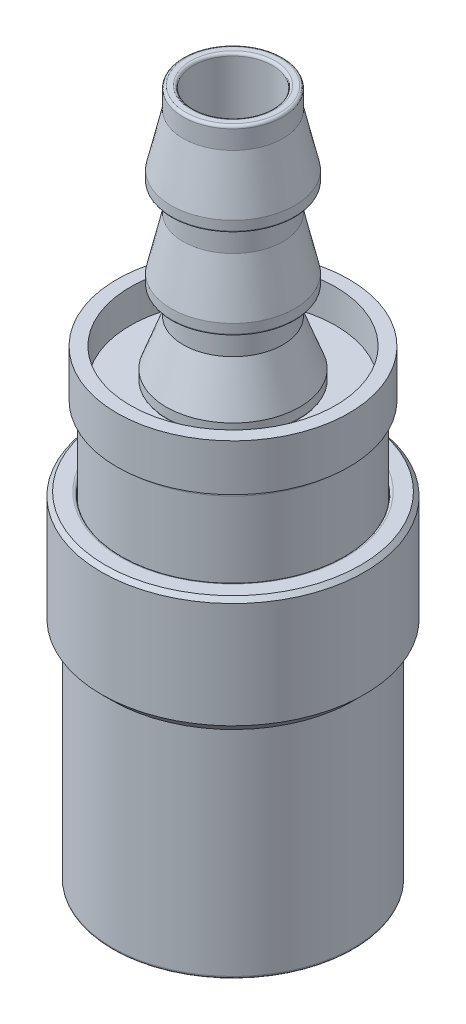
ISO-10303-21;
HEADER;
FILE_DESCRIPTION(('STEP AP214'),'2;1');
FILE_NAME('part.step','',(''),(''),'','','');
FILE_SCHEMA(('AUTOMOTIVE_DESIGN { 1 0 10303 214 1 1 1 1 }'));
ENDSEC;
DATA;
#1=APPLICATION_CONTEXT('core data for automotive mechanical design processes');
#2=APPLICATION_PROTOCOL_DEFINITION('international standard','automotive_design',2000,#1);
#3=PRODUCT_CONTEXT('',#1,'mechanical');
#4=PRODUCT('Part','Part','',(#3));
#5=PRODUCT_RELATED_PRODUCT_CATEGORY('part','',(#4));
#6=PRODUCT_DEFINITION_FORMATION('','',#4);
#7=PRODUCT_DEFINITION_CONTEXT('part definition',#1,'design');
#8=PRODUCT_DEFINITION('design','',#6,#7);
#9=PRODUCT_DEFINITION_SHAPE('','',#8);
#10=(LENGTH_UNIT() NAMED_UNIT(*) SI_UNIT(.MILLI.,.METRE.));
#11=(NAMED_UNIT(*) PLANE_ANGLE_UNIT() SI_UNIT($,.RADIAN.));
#12=(NAMED_UNIT(*) SI_UNIT($,.STERADIAN.) SOLID_ANGLE_UNIT());
#13=UNCERTAINTY_MEASURE_WITH_UNIT(LENGTH_MEASURE(1.E-05),#10,'distance_accuracy_value','');
#14=(GEOMETRIC_REPRESENTATION_CONTEXT(3) GLOBAL_UNCERTAINTY_ASSIGNED_CONTEXT((#13)) GLOBAL_UNIT_ASSIGNED_CONTEXT((#10,
#11,#12)) REPRESENTATION_CONTEXT('',''));
#15=CARTESIAN_POINT('',(0.,0.,0.));
#16=DIRECTION('',(0.,0.,1.));
#17=DIRECTION('',(1.,0.,0.));
#18=AXIS2_PLACEMENT_3D('',#15,#16,#17);
#19=CARTESIAN_POINT('',(0.,41.3766,0.));
#20=DIRECTION('',(0.,1.,0.));
#21=DIRECTION('',(0.,0.,1.));
#22=AXIS2_PLACEMENT_3D('',#19,#20,#21);
#23=TOROIDAL_SURFACE('',#22,6.22300020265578,0.127);
#24=CARTESIAN_POINT('',(0.,41.3766,0.));
#25=DIRECTION('',(0.,-1.,0.));
#26=DIRECTION('',(1.,0.,0.));
#27=AXIS2_PLACEMENT_3D('',#24,#25,#26);
#28=CIRCLE('',#27,6.35000020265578);
#29=CARTESIAN_POINT('',(-6.35000020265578,41.3766,0.));
#30=VERTEX_POINT('',#29);
#31=CARTESIAN_POINT('',(0.,41.3766,-6.35000020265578));
#32=VERTEX_POINT('',#31);
#33=EDGE_CURVE('P0_E11',#30,#32,#28,.T.);
#34=ORIENTED_EDGE('',*,*,#33,.T.);
#35=CARTESIAN_POINT('',(0.,41.3766,-6.22300020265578));
#36=DIRECTION('',(-1.,0.,0.));
#37=DIRECTION('',(0.,0.,-1.));
#38=AXIS2_PLACEMENT_3D('',#35,#36,#37);
#39=CIRCLE('',#38,0.127);
#40=CARTESIAN_POINT('',(0.,41.2496,-6.22300020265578));
#41=VERTEX_POINT('',#40);
#42=EDGE_CURVE('P0_E27',#32,#41,#39,.T.);
#43=ORIENTED_EDGE('',*,*,#42,.T.);
#44=CARTESIAN_POINT('',(0.,41.2496,0.));
#45=DIRECTION('',(0.,1.,0.));
#46=DIRECTION('',(1.,0.,0.));
#47=AXIS2_PLACEMENT_3D('',#44,#45,#46);
#48=CIRCLE('',#47,6.22300020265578);
#49=CARTESIAN_POINT('',(-6.22300020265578,41.2496,0.));
#50=VERTEX_POINT('',#49);
#51=EDGE_CURVE('P0_E493',#41,#50,#48,.T.);
#52=ORIENTED_EDGE('',*,*,#51,.T.);
#53=CARTESIAN_POINT('',(0.,41.2496,0.));
#54=DIRECTION('',(0.,1.,0.));
#55=DIRECTION('',(1.,0.,0.));
#56=AXIS2_PLACEMENT_3D('',#53,#54,#55);
#57=CIRCLE('',#56,6.22300020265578);
#58=EDGE_CURVE('P0_E490',#50,#41,#57,.T.);
#59=ORIENTED_EDGE('',*,*,#58,.T.);
#60=ORIENTED_EDGE('',*,*,#42,.F.);
#61=CARTESIAN_POINT('',(0.,41.3766,0.));
#62=DIRECTION('',(0.,-1.,0.));
#63=DIRECTION('',(1.,0.,0.));
#64=AXIS2_PLACEMENT_3D('',#61,#62,#63);
#65=CIRCLE('',#64,6.35000020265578);
#66=CARTESIAN_POINT('',(6.35000020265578,41.3766,0.));
#67=VERTEX_POINT('',#66);
#68=EDGE_CURVE('P0_E494',#32,#67,#65,.T.);
#69=ORIENTED_EDGE('',*,*,#68,.T.);
#70=CARTESIAN_POINT('',(0.,41.3766,0.));
#71=DIRECTION('',(0.,-1.,0.));
#72=DIRECTION('',(1.,0.,0.));
#73=AXIS2_PLACEMENT_3D('',#70,#71,#72);
#74=CIRCLE('',#73,6.35000020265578);
#75=EDGE_CURVE('P0_E350',#67,#30,#74,.T.);
#76=ORIENTED_EDGE('',*,*,#75,.T.);
#77=EDGE_LOOP('',(#34,#43,#52,#59,#60,#69,#76));
#78=FACE_BOUND('',#77,.T.);
#79=ADVANCED_FACE('P0_F16',(#78),#23,.T.);
#80=CARTESIAN_POINT('',(-6.35000020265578,41.2496,0.));
#81=DIRECTION('',(0.,-1.,0.));
#82=DIRECTION('',(0.,0.,-1.));
#83=AXIS2_PLACEMENT_3D('',#80,#81,#82);
#84=PLANE('',#83);
#85=ORIENTED_EDGE('',*,*,#58,.F.);
#86=ORIENTED_EDGE('',*,*,#51,.F.);
#87=EDGE_LOOP('',(#85,#86));
#88=FACE_BOUND('',#87,.T.);
#89=CARTESIAN_POINT('',(0.,41.2496,0.));
#90=DIRECTION('',(0.,1.,0.));
#91=DIRECTION('',(0.,0.,1.));
#92=AXIS2_PLACEMENT_3D('',#89,#90,#91);
#93=CIRCLE('',#92,5.6134);
#94=CARTESIAN_POINT('',(-5.6134,41.2496,0.));
#95=VERTEX_POINT('',#94);
#96=CARTESIAN_POINT('',(5.6134,41.2496,0.));
#97=VERTEX_POINT('',#96);
#98=EDGE_CURVE('P0_E569',#95,#97,#93,.T.);
#99=ORIENTED_EDGE('',*,*,#98,.T.);
#100=CARTESIAN_POINT('',(0.,41.2496,0.));
#101=DIRECTION('',(0.,1.,0.));
#102=DIRECTION('',(0.,0.,1.));
#103=AXIS2_PLACEMENT_3D('',#100,#101,#102);
#104=CIRCLE('',#103,5.6134);
#105=EDGE_CURVE('P0_E565',#97,#95,#104,.T.);
#106=ORIENTED_EDGE('',*,*,#105,.T.);
#107=EDGE_LOOP('',(#99,#106));
#108=FACE_BOUND('',#107,.T.);
#109=ADVANCED_FACE('P0_F905',(#88,#108),#84,.T.);
#110=CARTESIAN_POINT('',(0.,41.7576,0.));
#111=DIRECTION('',(0.,1.,0.));
#112=DIRECTION('',(-1.,0.,0.));
#113=AXIS2_PLACEMENT_3D('',#110,#111,#112);
#114=CYLINDRICAL_SURFACE('',#113,6.35000020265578);
#115=CARTESIAN_POINT('',(0.,42.2656,0.));
#116=DIRECTION('',(0.,1.,0.));
#117=DIRECTION('',(0.,0.,1.));
#118=AXIS2_PLACEMENT_3D('',#115,#116,#117);
#119=CIRCLE('',#118,6.35000020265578);
#120=CARTESIAN_POINT('',(-6.35000020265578,42.2656,0.));
#121=VERTEX_POINT('',#120);
#122=CARTESIAN_POINT('',(6.35000020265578,42.2656,0.));
#123=VERTEX_POINT('',#122);
#124=EDGE_CURVE('P0_E396',#121,#123,#119,.T.);
#125=ORIENTED_EDGE('',*,*,#124,.F.);
#126=CARTESIAN_POINT('',(0.,42.2656,0.));
#127=DIRECTION('',(0.,1.,0.));
#128=DIRECTION('',(0.,0.,1.));
#129=AXIS2_PLACEMENT_3D('',#126,#127,#128);
#130=CIRCLE('',#129,6.35000020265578);
#131=EDGE_CURVE('P0_E400',#123,#121,#130,.T.);
#132=ORIENTED_EDGE('',*,*,#131,.F.);
#133=DIRECTION('',(0.,-1.,0.));
#134=VECTOR('',#133,1.);
#135=CARTESIAN_POINT('',(6.35000020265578,41.7576,0.));
#136=LINE('',#135,#134);
#137=EDGE_CURVE('P0_E570',#123,#67,#136,.T.);
#138=ORIENTED_EDGE('',*,*,#137,.T.);
#139=ORIENTED_EDGE('',*,*,#68,.F.);
#140=ORIENTED_EDGE('',*,*,#33,.F.);
#141=ORIENTED_EDGE('',*,*,#75,.F.);
#142=ORIENTED_EDGE('',*,*,#137,.F.);
#143=EDGE_LOOP('',(#125,#132,#138,#139,#140,#141,#142));
#144=FACE_BOUND('',#143,.T.);
#145=ADVANCED_FACE('P0_F910',(#144),#114,.T.);
#146=CARTESIAN_POINT('',(0.,49.276,0.));
#147=DIRECTION('',(0.,1.,0.));
#148=DIRECTION('',(0.,0.,1.));
#149=AXIS2_PLACEMENT_3D('',#146,#147,#148);
#150=TOROIDAL_SURFACE('',#149,5.7658065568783,0.127);
#151=CARTESIAN_POINT('',(0.,49.276,0.));
#152=DIRECTION('',(0.,-1.,0.));
#153=DIRECTION('',(1.,0.,0.));
#154=AXIS2_PLACEMENT_3D('',#151,#152,#153);
#155=CIRCLE('',#154,5.8928065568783);
#156=CARTESIAN_POINT('',(-5.8928065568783,49.276,0.));
#157=VERTEX_POINT('',#156);
#158=CARTESIAN_POINT('',(0.,49.276,-5.8928065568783));
#159=VERTEX_POINT('',#158);
#160=EDGE_CURVE('P0_E578',#157,#159,#155,.T.);
#161=ORIENTED_EDGE('',*,*,#160,.T.);
#162=CARTESIAN_POINT('',(0.,49.276,-5.7658065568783));
#163=DIRECTION('',(-1.,0.,0.));
#164=DIRECTION('',(0.,0.,-1.));
#165=AXIS2_PLACEMENT_3D('',#162,#163,#164);
#166=CIRCLE('',#165,0.127);
#167=CARTESIAN_POINT('',(0.,49.149,-5.7658065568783));
#168=VERTEX_POINT('',#167);
#169=EDGE_CURVE('P0_E574',#159,#168,#166,.T.);
#170=ORIENTED_EDGE('',*,*,#169,.T.);
#171=CARTESIAN_POINT('',(0.,49.149,0.));
#172=DIRECTION('',(0.,1.,0.));
#173=DIRECTION('',(1.,0.,0.));
#174=AXIS2_PLACEMENT_3D('',#171,#172,#173);
#175=CIRCLE('',#174,5.7658065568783);
#176=CARTESIAN_POINT('',(-5.7658065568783,49.149,0.));
#177=VERTEX_POINT('',#176);
#178=EDGE_CURVE('P0_E579',#168,#177,#175,.T.);
#179=ORIENTED_EDGE('',*,*,#178,.T.);
#180=CARTESIAN_POINT('',(0.,49.149,0.));
#181=DIRECTION('',(0.,1.,0.));
#182=DIRECTION('',(1.,0.,0.));
#183=AXIS2_PLACEMENT_3D('',#180,#181,#182);
#184=CIRCLE('',#183,5.7658065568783);
#185=EDGE_CURVE('P0_E516',#177,#168,#184,.T.);
#186=ORIENTED_EDGE('',*,*,#185,.T.);
#187=ORIENTED_EDGE('',*,*,#169,.F.);
#188=CARTESIAN_POINT('',(0.,49.276,0.));
#189=DIRECTION('',(0.,-1.,0.));
#190=DIRECTION('',(1.,0.,0.));
#191=AXIS2_PLACEMENT_3D('',#188,#189,#190);
#192=CIRCLE('',#191,5.8928065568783);
#193=CARTESIAN_POINT('',(5.8928065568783,49.276,0.));
#194=VERTEX_POINT('',#193);
#195=EDGE_CURVE('P0_E512',#159,#194,#192,.T.);
#196=ORIENTED_EDGE('',*,*,#195,.T.);
#197=CARTESIAN_POINT('',(0.,49.276,0.));
#198=DIRECTION('',(0.,-1.,0.));
#199=DIRECTION('',(1.,0.,0.));
#200=AXIS2_PLACEMENT_3D('',#197,#198,#199);
#201=CIRCLE('',#200,5.8928065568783);
#202=EDGE_CURVE('P0_E517',#194,#157,#201,.T.);
#203=ORIENTED_EDGE('',*,*,#202,.T.);
#204=EDGE_LOOP('',(#161,#170,#179,#186,#187,#196,#203));
#205=FACE_BOUND('',#204,.T.);
#206=ADVANCED_FACE('P0_F919',(#205),#150,.T.);
#207=CARTESIAN_POINT('',(-5.89280697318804,49.149,0.));
#208=DIRECTION('',(0.,-1.,0.));
#209=DIRECTION('',(0.,0.,-1.));
#210=AXIS2_PLACEMENT_3D('',#207,#208,#209);
#211=PLANE('',#210);
#212=ORIENTED_EDGE('',*,*,#185,.F.);
#213=ORIENTED_EDGE('',*,*,#178,.F.);
#214=EDGE_LOOP('',(#212,#213));
#215=FACE_BOUND('',#214,.T.);
#216=CARTESIAN_POINT('',(0.,49.1489990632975,0.));
#217=DIRECTION('',(0.,1.,0.));
#218=DIRECTION('',(0.,0.,1.));
#219=AXIS2_PLACEMENT_3D('',#216,#217,#218);
#220=CIRCLE('',#219,4.7498);
#221=CARTESIAN_POINT('',(-4.7498,49.1489990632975,0.));
#222=VERTEX_POINT('',#221);
#223=CARTESIAN_POINT('',(4.7498,49.1489990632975,0.));
#224=VERTEX_POINT('',#223);
#225=EDGE_CURVE('P0_E688',#222,#224,#220,.T.);
#226=ORIENTED_EDGE('',*,*,#225,.T.);
#227=CARTESIAN_POINT('',(0.,49.1489990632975,0.));
#228=DIRECTION('',(0.,1.,0.));
#229=DIRECTION('',(0.,0.,1.));
#230=AXIS2_PLACEMENT_3D('',#227,#228,#229);
#231=CIRCLE('',#230,4.7498);
#232=EDGE_CURVE('P0_E548',#224,#222,#231,.T.);
#233=ORIENTED_EDGE('',*,*,#232,.T.);
#234=EDGE_LOOP('',(#226,#233));
#235=FACE_BOUND('',#234,.T.);
#236=ADVANCED_FACE('P0_F917',(#215,#235),#211,.T.);
#237=CARTESIAN_POINT('',(0.,49.657,0.));
#238=DIRECTION('',(0.,1.,0.));
#239=DIRECTION('',(-1.,0.,0.));
#240=AXIS2_PLACEMENT_3D('',#237,#238,#239);
#241=CYLINDRICAL_SURFACE('',#240,5.8928065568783);
#242=CARTESIAN_POINT('',(0.,50.165,0.));
#243=DIRECTION('',(0.,1.,0.));
#244=DIRECTION('',(0.,0.,1.));
#245=AXIS2_PLACEMENT_3D('',#242,#243,#244);
#246=CIRCLE('',#245,5.89280614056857);
#247=CARTESIAN_POINT('',(-5.89280614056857,50.165,0.));
#248=VERTEX_POINT('',#247);
#249=CARTESIAN_POINT('',(5.8928065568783,50.165,0.));
#250=VERTEX_POINT('',#249);
#251=EDGE_CURVE('P0_E362',#248,#250,#246,.T.);
#252=ORIENTED_EDGE('',*,*,#251,.F.);
#253=CARTESIAN_POINT('',(0.,50.165,0.));
#254=DIRECTION('',(0.,1.,0.));
#255=DIRECTION('',(0.,0.,1.));
#256=AXIS2_PLACEMENT_3D('',#253,#254,#255);
#257=CIRCLE('',#256,5.89280614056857);
#258=EDGE_CURVE('P0_E369',#250,#248,#257,.T.);
#259=ORIENTED_EDGE('',*,*,#258,.F.);
#260=DIRECTION('',(0.,-1.,0.));
#261=VECTOR('',#260,1.);
#262=CARTESIAN_POINT('',(5.8928065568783,49.657,0.));
#263=LINE('',#262,#261);
#264=EDGE_CURVE('P0_E544',#250,#194,#263,.T.);
#265=ORIENTED_EDGE('',*,*,#264,.T.);
#266=ORIENTED_EDGE('',*,*,#195,.F.);
#267=ORIENTED_EDGE('',*,*,#160,.F.);
#268=ORIENTED_EDGE('',*,*,#202,.F.);
#269=ORIENTED_EDGE('',*,*,#264,.F.);
#270=EDGE_LOOP('',(#252,#259,#265,#266,#267,#268,#269));
#271=FACE_BOUND('',#270,.T.);
#272=ADVANCED_FACE('P0_F624',(#271),#241,.T.);
#273=CARTESIAN_POINT('',(0.,57.785,0.));
#274=DIRECTION('',(0.,1.,0.));
#275=DIRECTION('',(0.,0.,1.));
#276=AXIS2_PLACEMENT_3D('',#273,#274,#275);
#277=TOROIDAL_SURFACE('',#276,5.7658,0.127);
#278=CARTESIAN_POINT('',(0.,57.785,0.));
#279=DIRECTION('',(0.,-1.,0.));
#280=DIRECTION('',(1.,0.,0.));
#281=AXIS2_PLACEMENT_3D('',#278,#279,#280);
#282=CIRCLE('',#281,5.8928);
#283=CARTESIAN_POINT('',(-5.8928,57.785,0.));
#284=VERTEX_POINT('',#283);
#285=CARTESIAN_POINT('',(0.,57.785,-5.8928));
#286=VERTEX_POINT('',#285);
#287=EDGE_CURVE('P0_E430',#284,#286,#282,.T.);
#288=ORIENTED_EDGE('',*,*,#287,.T.);
#289=CARTESIAN_POINT('',(0.,57.785,-5.7658));
#290=DIRECTION('',(-1.,0.,0.));
#291=DIRECTION('',(0.,0.,-1.));
#292=AXIS2_PLACEMENT_3D('',#289,#290,#291);
#293=CIRCLE('',#292,0.127);
#294=CARTESIAN_POINT('',(0.,57.658,-5.7658));
#295=VERTEX_POINT('',#294);
#296=EDGE_CURVE('P0_E426',#286,#295,#293,.T.);
#297=ORIENTED_EDGE('',*,*,#296,.T.);
#298=CARTESIAN_POINT('',(0.,57.658,0.));
#299=DIRECTION('',(0.,1.,0.));
#300=DIRECTION('',(1.,0.,0.));
#301=AXIS2_PLACEMENT_3D('',#298,#299,#300);
#302=CIRCLE('',#301,5.7658);
#303=CARTESIAN_POINT('',(-5.7658,57.658,0.));
#304=VERTEX_POINT('',#303);
#305=EDGE_CURVE('P0_E431',#295,#304,#302,.T.);
#306=ORIENTED_EDGE('',*,*,#305,.T.);
#307=CARTESIAN_POINT('',(0.,57.658,0.));
#308=DIRECTION('',(0.,1.,0.));
#309=DIRECTION('',(1.,0.,0.));
#310=AXIS2_PLACEMENT_3D('',#307,#308,#309);
#311=CIRCLE('',#310,5.7658);
#312=EDGE_CURVE('P0_E599',#304,#295,#311,.T.);
#313=ORIENTED_EDGE('',*,*,#312,.T.);
#314=ORIENTED_EDGE('',*,*,#296,.F.);
#315=CARTESIAN_POINT('',(0.,57.785,0.));
#316=DIRECTION('',(0.,-1.,0.));
#317=DIRECTION('',(1.,0.,0.));
#318=AXIS2_PLACEMENT_3D('',#315,#316,#317);
#319=CIRCLE('',#318,5.8928);
#320=CARTESIAN_POINT('',(5.8928,57.785,0.));
#321=VERTEX_POINT('',#320);
#322=EDGE_CURVE('P0_E602',#286,#321,#319,.T.);
#323=ORIENTED_EDGE('',*,*,#322,.T.);
#324=CARTESIAN_POINT('',(0.,57.785,0.));
#325=DIRECTION('',(0.,-1.,0.));
#326=DIRECTION('',(1.,0.,0.));
#327=AXIS2_PLACEMENT_3D('',#324,#325,#326);
#328=CIRCLE('',#327,5.8928);
#329=EDGE_CURVE('P0_E639',#321,#284,#328,.T.);
#330=ORIENTED_EDGE('',*,*,#329,.T.);
#331=EDGE_LOOP('',(#288,#297,#306,#313,#314,#323,#330));
#332=FACE_BOUND('',#331,.T.);
#333=ADVANCED_FACE('P0_F930',(#332),#277,.T.);
#334=CARTESIAN_POINT('',(-5.8928,57.658,0.));
#335=DIRECTION('',(0.,-1.,0.));
#336=DIRECTION('',(0.,0.,-1.));
#337=AXIS2_PLACEMENT_3D('',#334,#335,#336);
#338=PLANE('',#337);
#339=ORIENTED_EDGE('',*,*,#312,.F.);
#340=ORIENTED_EDGE('',*,*,#305,.F.);
#341=EDGE_LOOP('',(#339,#340));
#342=FACE_BOUND('',#341,.T.);
#343=CARTESIAN_POINT('',(0.,57.658,0.));
#344=DIRECTION('',(0.,1.,0.));
#345=DIRECTION('',(0.,0.,1.));
#346=AXIS2_PLACEMENT_3D('',#343,#344,#345);
#347=CIRCLE('',#346,4.7498);
#348=CARTESIAN_POINT('',(-4.7498,57.658,0.));
#349=VERTEX_POINT('',#348);
#350=CARTESIAN_POINT('',(4.7498,57.658,0.));
#351=VERTEX_POINT('',#350);
#352=EDGE_CURVE('P0_E634',#349,#351,#347,.T.);
#353=ORIENTED_EDGE('',*,*,#352,.T.);
#354=CARTESIAN_POINT('',(0.,57.658,0.));
#355=DIRECTION('',(0.,1.,0.));
#356=DIRECTION('',(0.,0.,1.));
#357=AXIS2_PLACEMENT_3D('',#354,#355,#356);
#358=CIRCLE('',#357,4.7498);
#359=EDGE_CURVE('P0_E520',#351,#349,#358,.T.);
#360=ORIENTED_EDGE('',*,*,#359,.T.);
#361=EDGE_LOOP('',(#353,#360));
#362=FACE_BOUND('',#361,.T.);
#363=ADVANCED_FACE('P0_F641',(#342,#362),#338,.T.);
#364=CARTESIAN_POINT('',(0.,58.166,0.));
#365=DIRECTION('',(0.,1.,0.));
#366=DIRECTION('',(-1.,0.,0.));
#367=AXIS2_PLACEMENT_3D('',#364,#365,#366);
#368=CYLINDRICAL_SURFACE('',#367,5.8928);
#369=CARTESIAN_POINT('',(0.,58.674,0.));
#370=DIRECTION('',(0.,1.,0.));
#371=DIRECTION('',(0.,0.,1.));
#372=AXIS2_PLACEMENT_3D('',#369,#370,#371);
#373=CIRCLE('',#372,5.8928);
#374=CARTESIAN_POINT('',(-5.8928,58.674,0.));
#375=VERTEX_POINT('',#374);
#376=CARTESIAN_POINT('',(5.8928,58.674,0.));
#377=VERTEX_POINT('',#376);
#378=EDGE_CURVE('P0_E687',#375,#377,#373,.T.);
#379=ORIENTED_EDGE('',*,*,#378,.F.);
#380=CARTESIAN_POINT('',(0.,58.674,0.));
#381=DIRECTION('',(0.,1.,0.));
#382=DIRECTION('',(0.,0.,1.));
#383=AXIS2_PLACEMENT_3D('',#380,#381,#382);
#384=CIRCLE('',#383,5.8928);
#385=EDGE_CURVE('P0_E511',#377,#375,#384,.T.);
#386=ORIENTED_EDGE('',*,*,#385,.F.);
#387=DIRECTION('',(0.,-1.,0.));
#388=VECTOR('',#387,1.);
#389=CARTESIAN_POINT('',(5.8928,58.166,0.));
#390=LINE('',#389,#388);
#391=EDGE_CURVE('P0_E462',#377,#321,#390,.T.);
#392=ORIENTED_EDGE('',*,*,#391,.T.);
#393=ORIENTED_EDGE('',*,*,#322,.F.);
#394=ORIENTED_EDGE('',*,*,#287,.F.);
#395=ORIENTED_EDGE('',*,*,#329,.F.);
#396=ORIENTED_EDGE('',*,*,#391,.F.);
#397=EDGE_LOOP('',(#379,#386,#392,#393,#394,#395,#396));
#398=FACE_BOUND('',#397,.T.);
#399=ADVANCED_FACE('P0_F1161',(#398),#368,.T.);
#400=CARTESIAN_POINT('',(0.,0.254,0.));
#401=DIRECTION('',(0.,1.,0.));
#402=DIRECTION('',(0.,0.,1.));
#403=AXIS2_PLACEMENT_3D('',#400,#401,#402);
#404=TOROIDAL_SURFACE('',#403,8.6995,0.254);
#405=CARTESIAN_POINT('',(0.,0.254,0.));
#406=DIRECTION('',(0.,-1.,0.));
#407=DIRECTION('',(1.,0.,0.));
#408=AXIS2_PLACEMENT_3D('',#405,#406,#407);
#409=CIRCLE('',#408,8.9535);
#410=CARTESIAN_POINT('',(-8.9535,0.254,0.));
#411=VERTEX_POINT('',#410);
#412=CARTESIAN_POINT('',(0.,0.254,-8.9535));
#413=VERTEX_POINT('',#412);
#414=EDGE_CURVE('P0_E458',#411,#413,#409,.T.);
#415=ORIENTED_EDGE('',*,*,#414,.T.);
#416=CARTESIAN_POINT('',(0.,0.254,-8.6995));
#417=DIRECTION('',(-1.,0.,0.));
#418=DIRECTION('',(0.,0.,-1.));
#419=AXIS2_PLACEMENT_3D('',#416,#417,#418);
#420=CIRCLE('',#419,0.254);
#421=CARTESIAN_POINT('',(0.,0.,-8.6995));
#422=VERTEX_POINT('',#421);
#423=EDGE_CURVE('P0_E463',#413,#422,#420,.T.);
#424=ORIENTED_EDGE('',*,*,#423,.T.);
#425=CARTESIAN_POINT('',(0.,0.,0.));
#426=DIRECTION('',(0.,1.,0.));
#427=DIRECTION('',(1.,0.,0.));
#428=AXIS2_PLACEMENT_3D('',#425,#426,#427);
#429=CIRCLE('',#428,8.6995);
#430=CARTESIAN_POINT('',(-8.6995,0.,0.));
#431=VERTEX_POINT('',#430);
#432=EDGE_CURVE('P0_E612',#422,#431,#429,.T.);
#433=ORIENTED_EDGE('',*,*,#432,.T.);
#434=CARTESIAN_POINT('',(0.,0.,0.));
#435=DIRECTION('',(0.,1.,0.));
#436=DIRECTION('',(1.,0.,0.));
#437=AXIS2_PLACEMENT_3D('',#434,#435,#436);
#438=CIRCLE('',#437,8.6995);
#439=EDGE_CURVE('P0_E608',#431,#422,#438,.T.);
#440=ORIENTED_EDGE('',*,*,#439,.T.);
#441=ORIENTED_EDGE('',*,*,#423,.F.);
#442=CARTESIAN_POINT('',(0.,0.254,0.));
#443=DIRECTION('',(0.,-1.,0.));
#444=DIRECTION('',(1.,0.,0.));
#445=AXIS2_PLACEMENT_3D('',#442,#443,#444);
#446=CIRCLE('',#445,8.9535);
#447=CARTESIAN_POINT('',(8.9535,0.254,0.));
#448=VERTEX_POINT('',#447);
#449=EDGE_CURVE('P0_E533',#413,#448,#446,.T.);
#450=ORIENTED_EDGE('',*,*,#449,.T.);
#451=CARTESIAN_POINT('',(0.,0.254,0.));
#452=DIRECTION('',(0.,-1.,0.));
#453=DIRECTION('',(1.,0.,0.));
#454=AXIS2_PLACEMENT_3D('',#451,#452,#453);
#455=CIRCLE('',#454,8.9535);
#456=EDGE_CURVE('P0_E529',#448,#411,#455,.T.);
#457=ORIENTED_EDGE('',*,*,#456,.T.);
#458=EDGE_LOOP('',(#415,#424,#433,#440,#441,#450,#457));
#459=FACE_BOUND('',#458,.T.);
#460=ADVANCED_FACE('P0_F877',(#459),#404,.T.);
#461=CARTESIAN_POINT('',(-8.9535,0.,0.));
#462=DIRECTION('',(0.,-1.,0.));
#463=DIRECTION('',(0.,0.,-1.));
#464=AXIS2_PLACEMENT_3D('',#461,#462,#463);
#465=PLANE('',#464);
#466=ORIENTED_EDGE('',*,*,#439,.F.);
#467=ORIENTED_EDGE('',*,*,#432,.F.);
#468=EDGE_LOOP('',(#466,#467));
#469=FACE_BOUND('',#468,.T.);
#470=CARTESIAN_POINT('',(0.,0.,0.));
#471=DIRECTION('',(0.,-1.,0.));
#472=DIRECTION('',(1.,0.,0.));
#473=AXIS2_PLACEMENT_3D('',#470,#471,#472);
#474=CIRCLE('',#473,7.7597);
#475=CARTESIAN_POINT('',(-7.7597,0.,0.));
#476=VERTEX_POINT('',#475);
#477=EDGE_CURVE('P0_E540',#476,#476,#474,.T.);
#478=ORIENTED_EDGE('',*,*,#477,.F.);
#479=EDGE_LOOP('',(#478));
#480=FACE_BOUND('',#479,.T.);
#481=ADVANCED_FACE('P0_F883',(#469,#480),#465,.T.);
#482=CARTESIAN_POINT('',(0.,8.89,0.));
#483=DIRECTION('',(0.,1.,0.));
#484=DIRECTION('',(-1.,0.,0.));
#485=AXIS2_PLACEMENT_3D('',#482,#483,#484);
#486=CYLINDRICAL_SURFACE('',#485,8.9535);
#487=CARTESIAN_POINT('',(0.,17.78,0.));
#488=DIRECTION('',(0.,1.,0.));
#489=DIRECTION('',(0.,0.,1.));
#490=AXIS2_PLACEMENT_3D('',#487,#488,#489);
#491=CIRCLE('',#490,8.9535);
#492=CARTESIAN_POINT('',(-8.9535,17.78,0.));
#493=VERTEX_POINT('',#492);
#494=CARTESIAN_POINT('',(8.9535,17.78,0.));
#495=VERTEX_POINT('',#494);
#496=EDGE_CURVE('P0_E413',#493,#495,#491,.T.);
#497=ORIENTED_EDGE('',*,*,#496,.F.);
#498=CARTESIAN_POINT('',(0.,17.78,0.));
#499=DIRECTION('',(0.,1.,0.));
#500=DIRECTION('',(0.,0.,1.));
#501=AXIS2_PLACEMENT_3D('',#498,#499,#500);
#502=CIRCLE('',#501,8.9535);
#503=EDGE_CURVE('P0_E674',#495,#493,#502,.T.);
#504=ORIENTED_EDGE('',*,*,#503,.F.);
#505=DIRECTION('',(0.,-1.,0.));
#506=VECTOR('',#505,1.);
#507=CARTESIAN_POINT('',(8.9535,8.89,0.));
#508=LINE('',#507,#506);
#509=EDGE_CURVE('P0_E534',#495,#448,#508,.T.);
#510=ORIENTED_EDGE('',*,*,#509,.T.);
#511=ORIENTED_EDGE('',*,*,#449,.F.);
#512=ORIENTED_EDGE('',*,*,#414,.F.);
#513=ORIENTED_EDGE('',*,*,#456,.F.);
#514=ORIENTED_EDGE('',*,*,#509,.F.);
#515=EDGE_LOOP('',(#497,#504,#510,#511,#512,#513,#514));
#516=FACE_BOUND('',#515,.T.);
#517=ADVANCED_FACE('P0_F880',(#516),#486,.T.);
#518=CARTESIAN_POINT('',(0.,18.034,0.));
#519=DIRECTION('',(0.,1.,0.));
#520=DIRECTION('',(0.,0.,1.));
#521=AXIS2_PLACEMENT_3D('',#518,#519,#520);
#522=TOROIDAL_SURFACE('',#521,10.2362,0.254);
#523=CARTESIAN_POINT('',(0.,18.034,0.));
#524=DIRECTION('',(0.,-1.,0.));
#525=DIRECTION('',(1.,0.,0.));
#526=AXIS2_PLACEMENT_3D('',#523,#524,#525);
#527=CIRCLE('',#526,10.4902);
#528=CARTESIAN_POINT('',(-10.4902,18.034,0.));
#529=VERTEX_POINT('',#528);
#530=CARTESIAN_POINT('',(0.,18.034,-10.4902));
#531=VERTEX_POINT('',#530);
#532=EDGE_CURVE('P0_E594',#529,#531,#527,.T.);
#533=ORIENTED_EDGE('',*,*,#532,.T.);
#534=CARTESIAN_POINT('',(0.,18.034,-10.2362));
#535=DIRECTION('',(-1.,0.,0.));
#536=DIRECTION('',(0.,0.,-1.));
#537=AXIS2_PLACEMENT_3D('',#534,#535,#536);
#538=CIRCLE('',#537,0.254);
#539=CARTESIAN_POINT('',(0.,17.78,-10.2362));
#540=VERTEX_POINT('',#539);
#541=EDGE_CURVE('P0_E586',#531,#540,#538,.T.);
#542=ORIENTED_EDGE('',*,*,#541,.T.);
#543=CARTESIAN_POINT('',(0.,17.78,0.));
#544=DIRECTION('',(0.,1.,0.));
#545=DIRECTION('',(1.,0.,0.));
#546=AXIS2_PLACEMENT_3D('',#543,#544,#545);
#547=CIRCLE('',#546,10.2362);
#548=CARTESIAN_POINT('',(-10.2362,17.78,0.));
#549=VERTEX_POINT('',#548);
#550=EDGE_CURVE('P0_E583',#540,#549,#547,.T.);
#551=ORIENTED_EDGE('',*,*,#550,.T.);
#552=CARTESIAN_POINT('',(0.,17.78,0.));
#553=DIRECTION('',(0.,1.,0.));
#554=DIRECTION('',(1.,0.,0.));
#555=AXIS2_PLACEMENT_3D('',#552,#553,#554);
#556=CIRCLE('',#555,10.2362);
#557=EDGE_CURVE('P0_E587',#549,#540,#556,.T.);
#558=ORIENTED_EDGE('',*,*,#557,.T.);
#559=ORIENTED_EDGE('',*,*,#541,.F.);
#560=CARTESIAN_POINT('',(0.,18.034,0.));
#561=DIRECTION('',(0.,-1.,0.));
#562=DIRECTION('',(1.,0.,0.));
#563=AXIS2_PLACEMENT_3D('',#560,#561,#562);
#564=CIRCLE('',#563,10.4902);
#565=CARTESIAN_POINT('',(10.4902,18.034,0.));
#566=VERTEX_POINT('',#565);
#567=EDGE_CURVE('P0_E598',#531,#566,#564,.T.);
#568=ORIENTED_EDGE('',*,*,#567,.T.);
#569=CARTESIAN_POINT('',(0.,18.034,0.));
#570=DIRECTION('',(0.,-1.,0.));
#571=DIRECTION('',(1.,0.,0.));
#572=AXIS2_PLACEMENT_3D('',#569,#570,#571);
#573=CIRCLE('',#572,10.4902);
#574=EDGE_CURVE('P0_E412',#566,#529,#573,.T.);
#575=ORIENTED_EDGE('',*,*,#574,.T.);
#576=EDGE_LOOP('',(#533,#542,#551,#558,#559,#568,#575));
#577=FACE_BOUND('',#576,.T.);
#578=ADVANCED_FACE('P0_F915',(#577),#522,.T.);
#579=CARTESIAN_POINT('',(0.,28.7274,0.));
#580=DIRECTION('',(0.,1.,0.));
#581=DIRECTION('',(-1.,0.,0.));
#582=AXIS2_PLACEMENT_3D('',#579,#580,#581);
#583=CYLINDRICAL_SURFACE('',#582,10.4902);
#584=CARTESIAN_POINT('',(0.,39.1668,0.));
#585=DIRECTION('',(0.,1.,0.));
#586=DIRECTION('',(1.,0.,0.));
#587=AXIS2_PLACEMENT_3D('',#584,#585,#586);
#588=CIRCLE('',#587,10.4902);
#589=CARTESIAN_POINT('',(-10.4902,39.1668,0.));
#590=VERTEX_POINT('',#589);
#591=CARTESIAN_POINT('',(10.4902,39.1668,0.));
#592=VERTEX_POINT('',#591);
#593=EDGE_CURVE('P0_E712',#590,#592,#588,.T.);
#594=ORIENTED_EDGE('',*,*,#593,.F.);
#595=CARTESIAN_POINT('',(0.,39.1668,0.));
#596=DIRECTION('',(0.,1.,0.));
#597=DIRECTION('',(1.,0.,0.));
#598=AXIS2_PLACEMENT_3D('',#595,#596,#597);
#599=CIRCLE('',#598,10.4902);
#600=CARTESIAN_POINT('',(0.,39.1668,-10.4902));
#601=VERTEX_POINT('',#600);
#602=EDGE_CURVE('P0_E716',#601,#590,#599,.T.);
#603=ORIENTED_EDGE('',*,*,#602,.F.);
#604=CARTESIAN_POINT('',(0.,39.1668,0.));
#605=DIRECTION('',(0.,1.,0.));
#606=DIRECTION('',(1.,0.,0.));
#607=AXIS2_PLACEMENT_3D('',#604,#605,#606);
#608=CIRCLE('',#607,10.4902);
#609=EDGE_CURVE('P0_E539',#592,#601,#608,.T.);
#610=ORIENTED_EDGE('',*,*,#609,.F.);
#611=DIRECTION('',(0.,-1.,0.));
#612=VECTOR('',#611,1.);
#613=CARTESIAN_POINT('',(10.4902,28.7274,0.));
#614=LINE('',#613,#612);
#615=EDGE_CURVE('P0_E408',#592,#566,#614,.T.);
#616=ORIENTED_EDGE('',*,*,#615,.T.);
#617=ORIENTED_EDGE('',*,*,#567,.F.);
#618=ORIENTED_EDGE('',*,*,#532,.F.);
#619=ORIENTED_EDGE('',*,*,#574,.F.);
#620=ORIENTED_EDGE('',*,*,#615,.F.);
#621=EDGE_LOOP('',(#594,#603,#610,#616,#617,#618,#619,#620));
#622=FACE_BOUND('',#621,.T.);
#623=ADVANCED_FACE('P0_F823',(#622),#583,.T.);
#624=CARTESIAN_POINT('',(-10.4902,17.78,0.));
#625=DIRECTION('',(0.,-1.,0.));
#626=DIRECTION('',(0.,0.,-1.));
#627=AXIS2_PLACEMENT_3D('',#624,#625,#626);
#628=PLANE('',#627);
#629=ORIENTED_EDGE('',*,*,#557,.F.);
#630=ORIENTED_EDGE('',*,*,#550,.F.);
#631=EDGE_LOOP('',(#629,#630));
#632=FACE_BOUND('',#631,.T.);
#633=ORIENTED_EDGE('',*,*,#496,.T.);
#634=ORIENTED_EDGE('',*,*,#503,.T.);
#635=EDGE_LOOP('',(#633,#634));
#636=FACE_BOUND('',#635,.T.);
#637=ADVANCED_FACE('P0_F978',(#632,#636),#628,.T.);
#638=CARTESIAN_POINT('',(0.,65.405,0.));
#639=DIRECTION('',(0.,1.,0.));
#640=DIRECTION('',(0.,0.,1.));
#641=AXIS2_PLACEMENT_3D('',#638,#639,#640);
#642=TOROIDAL_SURFACE('',#641,4.0132,0.254);
#643=CARTESIAN_POINT('',(0.,65.405,0.));
#644=DIRECTION('',(0.,-1.,0.));
#645=DIRECTION('',(1.,0.,0.));
#646=AXIS2_PLACEMENT_3D('',#643,#644,#645);
#647=CIRCLE('',#646,3.7592);
#648=CARTESIAN_POINT('',(-3.7592,65.405,0.));
#649=VERTEX_POINT('',#648);
#650=CARTESIAN_POINT('',(0.,65.405,-3.7592));
#651=VERTEX_POINT('',#650);
#652=EDGE_CURVE('P0_E678',#649,#651,#647,.T.);
#653=ORIENTED_EDGE('',*,*,#652,.T.);
#654=CARTESIAN_POINT('',(0.,65.405,-4.0132));
#655=DIRECTION('',(-1.,0.,0.));
#656=DIRECTION('',(0.,0.,-1.));
#657=AXIS2_PLACEMENT_3D('',#654,#655,#656);
#658=CIRCLE('',#657,0.254);
#659=CARTESIAN_POINT('',(0.,65.659,-4.0132));
#660=VERTEX_POINT('',#659);
#661=EDGE_CURVE('P0_E557',#651,#660,#658,.T.);
#662=ORIENTED_EDGE('',*,*,#661,.T.);
#663=CARTESIAN_POINT('',(0.,65.659,0.));
#664=DIRECTION('',(0.,1.,0.));
#665=DIRECTION('',(1.,0.,0.));
#666=AXIS2_PLACEMENT_3D('',#663,#664,#665);
#667=CIRCLE('',#666,4.0132);
#668=CARTESIAN_POINT('',(-4.0132,65.659,0.));
#669=VERTEX_POINT('',#668);
#670=EDGE_CURVE('P0_E374',#660,#669,#667,.T.);
#671=ORIENTED_EDGE('',*,*,#670,.T.);
#672=CARTESIAN_POINT('',(0.,65.659,0.));
#673=DIRECTION('',(0.,1.,0.));
#674=DIRECTION('',(1.,0.,0.));
#675=AXIS2_PLACEMENT_3D('',#672,#673,#674);
#676=CIRCLE('',#675,4.0132);
#677=EDGE_CURVE('P0_E370',#669,#660,#676,.T.);
#678=ORIENTED_EDGE('',*,*,#677,.T.);
#679=ORIENTED_EDGE('',*,*,#661,.F.);
#680=CARTESIAN_POINT('',(0.,65.405,0.));
#681=DIRECTION('',(0.,-1.,0.));
#682=DIRECTION('',(1.,0.,0.));
#683=AXIS2_PLACEMENT_3D('',#680,#681,#682);
#684=CIRCLE('',#683,3.7592);
#685=CARTESIAN_POINT('',(3.7592,65.405,0.));
#686=VERTEX_POINT('',#685);
#687=EDGE_CURVE('P0_E375',#651,#686,#684,.T.);
#688=ORIENTED_EDGE('',*,*,#687,.T.);
#689=CARTESIAN_POINT('',(0.,65.405,0.));
#690=DIRECTION('',(0.,-1.,0.));
#691=DIRECTION('',(1.,0.,0.));
#692=AXIS2_PLACEMENT_3D('',#689,#690,#691);
#693=CIRCLE('',#692,3.7592);
#694=EDGE_CURVE('P0_E439',#686,#649,#693,.T.);
#695=ORIENTED_EDGE('',*,*,#694,.T.);
#696=EDGE_LOOP('',(#653,#662,#671,#678,#679,#688,#695));
#697=FACE_BOUND('',#696,.T.);
#698=ADVANCED_FACE('P0_F965',(#697),#642,.T.);
#699=CARTESIAN_POINT('',(-3.7592,65.659,0.));
#700=DIRECTION('',(0.,1.,0.));
#701=DIRECTION('',(1.,0.,0.));
#702=AXIS2_PLACEMENT_3D('',#699,#700,#701);
#703=PLANE('',#702);
#704=CARTESIAN_POINT('',(0.,65.659,0.));
#705=DIRECTION('',(0.,-1.,0.));
#706=DIRECTION('',(1.,0.,0.));
#707=AXIS2_PLACEMENT_3D('',#704,#705,#706);
#708=CIRCLE('',#707,4.49579999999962);
#709=CARTESIAN_POINT('',(-4.49579999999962,65.659,0.));
#710=VERTEX_POINT('',#709);
#711=CARTESIAN_POINT('',(0.,65.659,-4.49579999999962));
#712=VERTEX_POINT('',#711);
#713=EDGE_CURVE('P0_E489',#710,#712,#708,.T.);
#714=ORIENTED_EDGE('',*,*,#713,.F.);
#715=CARTESIAN_POINT('',(0.,65.659,0.));
#716=DIRECTION('',(0.,-1.,0.));
#717=DIRECTION('',(1.,0.,0.));
#718=AXIS2_PLACEMENT_3D('',#715,#716,#717);
#719=CIRCLE('',#718,4.49579999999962);
#720=EDGE_CURVE('P0_E357',#712,#710,#719,.T.);
#721=ORIENTED_EDGE('',*,*,#720,.F.);
#722=EDGE_LOOP('',(#714,#721));
#723=FACE_BOUND('',#722,.T.);
#724=ORIENTED_EDGE('',*,*,#677,.F.);
#725=ORIENTED_EDGE('',*,*,#670,.F.);
#726=EDGE_LOOP('',(#724,#725));
#727=FACE_BOUND('',#726,.T.);
#728=ADVANCED_FACE('P0_F968',(#723,#727),#703,.T.);
#729=CARTESIAN_POINT('',(0.,49.8856,0.));
#730=DIRECTION('',(0.,1.,0.));
#731=DIRECTION('',(-1.,0.,0.));
#732=AXIS2_PLACEMENT_3D('',#729,#730,#731);
#733=CYLINDRICAL_SURFACE('',#732,3.7592);
#734=ORIENTED_EDGE('',*,*,#652,.F.);
#735=ORIENTED_EDGE('',*,*,#694,.F.);
#736=DIRECTION('',(0.,-1.,0.));
#737=VECTOR('',#736,1.);
#738=CARTESIAN_POINT('',(3.7592,49.8856,0.));
#739=LINE('',#738,#737);
#740=CARTESIAN_POINT('',(3.7592,34.1122,0.));
#741=VERTEX_POINT('',#740);
#742=EDGE_CURVE('P0_E485',#686,#741,#739,.T.);
#743=ORIENTED_EDGE('',*,*,#742,.T.);
#744=CARTESIAN_POINT('',(0.,34.1122,0.));
#745=DIRECTION('',(0.,1.,0.));
#746=DIRECTION('',(0.,0.,1.));
#747=AXIS2_PLACEMENT_3D('',#744,#745,#746);
#748=CIRCLE('',#747,3.7592);
#749=CARTESIAN_POINT('',(-3.7592,34.1122,0.));
#750=VERTEX_POINT('',#749);
#751=EDGE_CURVE('P0_E561',#750,#741,#748,.T.);
#752=ORIENTED_EDGE('',*,*,#751,.F.);
#753=CARTESIAN_POINT('',(0.,34.1122,0.));
#754=DIRECTION('',(0.,1.,0.));
#755=DIRECTION('',(0.,0.,1.));
#756=AXIS2_PLACEMENT_3D('',#753,#754,#755);
#757=CIRCLE('',#756,3.7592);
#758=EDGE_CURVE('P0_E552',#741,#750,#757,.T.);
#759=ORIENTED_EDGE('',*,*,#758,.F.);
#760=ORIENTED_EDGE('',*,*,#742,.F.);
#761=ORIENTED_EDGE('',*,*,#687,.F.);
#762=EDGE_LOOP('',(#734,#735,#743,#752,#759,#760,#761));
#763=FACE_BOUND('',#762,.T.);
#764=ADVANCED_FACE('P0_F962',(#763),#733,.F.);
#765=CARTESIAN_POINT('',(0.,65.405,0.));
#766=DIRECTION('',(0.,1.,0.));
#767=DIRECTION('',(0.,0.,1.));
#768=AXIS2_PLACEMENT_3D('',#765,#766,#767);
#769=TOROIDAL_SURFACE('',#768,4.49579999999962,0.254);
#770=ORIENTED_EDGE('',*,*,#713,.T.);
#771=CARTESIAN_POINT('',(0.,65.405,-4.49579999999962));
#772=DIRECTION('',(-1.,0.,0.));
#773=DIRECTION('',(0.,0.,-1.));
#774=AXIS2_PLACEMENT_3D('',#771,#772,#773);
#775=CIRCLE('',#774,0.254);
#776=CARTESIAN_POINT('',(0.,65.405,-4.74979999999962));
#777=VERTEX_POINT('',#776);
#778=EDGE_CURVE('P0_E20',#712,#777,#775,.T.);
#779=ORIENTED_EDGE('',*,*,#778,.T.);
#780=CARTESIAN_POINT('',(0.,65.405,0.));
#781=DIRECTION('',(0.,1.,0.));
#782=DIRECTION('',(1.,0.,0.));
#783=AXIS2_PLACEMENT_3D('',#780,#781,#782);
#784=CIRCLE('',#783,4.74979999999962);
#785=CARTESIAN_POINT('',(-4.74979999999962,65.405,0.));
#786=VERTEX_POINT('',#785);
#787=EDGE_CURVE('P0_E522',#777,#786,#784,.T.);
#788=ORIENTED_EDGE('',*,*,#787,.T.);
#789=CARTESIAN_POINT('',(0.,65.405,0.));
#790=DIRECTION('',(0.,1.,0.));
#791=DIRECTION('',(1.,0.,0.));
#792=AXIS2_PLACEMENT_3D('',#789,#790,#791);
#793=CIRCLE('',#792,4.74979999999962);
#794=CARTESIAN_POINT('',(4.74979999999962,65.405,0.));
#795=VERTEX_POINT('',#794);
#796=EDGE_CURVE('P0_E356',#786,#795,#793,.T.);
#797=ORIENTED_EDGE('',*,*,#796,.T.);
#798=CARTESIAN_POINT('',(0.,65.405,0.));
#799=DIRECTION('',(0.,1.,0.));
#800=DIRECTION('',(1.,0.,0.));
#801=AXIS2_PLACEMENT_3D('',#798,#799,#800);
#802=CIRCLE('',#801,4.74979999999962);
#803=EDGE_CURVE('P0_E352',#795,#777,#802,.T.);
#804=ORIENTED_EDGE('',*,*,#803,.T.);
#805=ORIENTED_EDGE('',*,*,#778,.F.);
#806=ORIENTED_EDGE('',*,*,#720,.T.);
#807=EDGE_LOOP('',(#770,#779,#788,#797,#804,#805,#806));
#808=FACE_BOUND('',#807,.T.);
#809=ADVANCED_FACE('P0_F976',(#808),#769,.T.);
#810=CARTESIAN_POINT('',(0.,64.643,0.));
#811=DIRECTION('',(0.,1.,0.));
#812=DIRECTION('',(-1.,0.,0.));
#813=AXIS2_PLACEMENT_3D('',#810,#811,#812);
#814=CYLINDRICAL_SURFACE('',#813,4.74979999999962);
#815=ORIENTED_EDGE('',*,*,#796,.F.);
#816=ORIENTED_EDGE('',*,*,#787,.F.);
#817=ORIENTED_EDGE('',*,*,#803,.F.);
#818=DIRECTION('',(0.,-1.,0.));
#819=VECTOR('',#818,1.);
#820=CARTESIAN_POINT('',(4.74979999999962,64.643,0.));
#821=LINE('',#820,#819);
#822=CARTESIAN_POINT('',(4.74979999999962,63.627,0.));
#823=VERTEX_POINT('',#822);
#824=EDGE_CURVE('P0_E331',#795,#823,#821,.T.);
#825=ORIENTED_EDGE('',*,*,#824,.T.);
#826=CARTESIAN_POINT('',(0.,63.627,0.));
#827=DIRECTION('',(0.,1.,0.));
#828=DIRECTION('',(0.,0.,1.));
#829=AXIS2_PLACEMENT_3D('',#826,#827,#828);
#830=CIRCLE('',#829,4.74979999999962);
#831=CARTESIAN_POINT('',(-4.74979999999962,63.627,0.));
#832=VERTEX_POINT('',#831);
#833=EDGE_CURVE('P0_E325',#823,#832,#830,.T.);
#834=ORIENTED_EDGE('',*,*,#833,.T.);
#835=CARTESIAN_POINT('',(0.,63.627,0.));
#836=DIRECTION('',(0.,1.,0.));
#837=DIRECTION('',(0.,0.,1.));
#838=AXIS2_PLACEMENT_3D('',#835,#836,#837);
#839=CIRCLE('',#838,4.74979999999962);
#840=EDGE_CURVE('P0_E330',#832,#823,#839,.T.);
#841=ORIENTED_EDGE('',*,*,#840,.T.);
#842=ORIENTED_EDGE('',*,*,#824,.F.);
#843=EDGE_LOOP('',(#815,#816,#817,#825,#834,#841,#842));
#844=FACE_BOUND('',#843,.T.);
#845=ADVANCED_FACE('P0_F328',(#844),#814,.T.);
#846=CARTESIAN_POINT('',(0.,39.1668,0.));
#847=DIRECTION('',(0.,1.,0.));
#848=DIRECTION('',(0.,0.,1.));
#849=AXIS2_PLACEMENT_3D('',#846,#847,#848);
#850=TOROIDAL_SURFACE('',#849,9.9822,0.508);
#851=CARTESIAN_POINT('',(0.,39.6748,0.));
#852=DIRECTION('',(0.,-1.,0.));
#853=DIRECTION('',(1.,0.,0.));
#854=AXIS2_PLACEMENT_3D('',#851,#852,#853);
#855=CIRCLE('',#854,9.9822);
#856=CARTESIAN_POINT('',(-9.9822,39.6748,0.));
#857=VERTEX_POINT('',#856);
#858=CARTESIAN_POINT('',(0.,39.6748,-9.9822));
#859=VERTEX_POINT('',#858);
#860=EDGE_CURVE('P0_E339',#857,#859,#855,.T.);
#861=ORIENTED_EDGE('',*,*,#860,.T.);
#862=CARTESIAN_POINT('',(0.,39.1668,-9.9822));
#863=DIRECTION('',(-1.,0.,0.));
#864=DIRECTION('',(0.,0.,-1.));
#865=AXIS2_PLACEMENT_3D('',#862,#863,#864);
#866=CIRCLE('',#865,0.508);
#867=EDGE_CURVE('P0_E346',#859,#601,#866,.T.);
#868=ORIENTED_EDGE('',*,*,#867,.T.);
#869=ORIENTED_EDGE('',*,*,#602,.T.);
#870=ORIENTED_EDGE('',*,*,#593,.T.);
#871=ORIENTED_EDGE('',*,*,#609,.T.);
#872=ORIENTED_EDGE('',*,*,#867,.F.);
#873=CARTESIAN_POINT('',(0.,39.6748,0.));
#874=DIRECTION('',(0.,-1.,0.));
#875=DIRECTION('',(1.,0.,0.));
#876=AXIS2_PLACEMENT_3D('',#873,#874,#875);
#877=CIRCLE('',#876,9.9822);
#878=EDGE_CURVE('P0_E535',#859,#857,#877,.T.);
#879=ORIENTED_EDGE('',*,*,#878,.T.);
#880=EDGE_LOOP('',(#861,#868,#869,#870,#871,#872,#879));
#881=FACE_BOUND('',#880,.T.);
#882=ADVANCED_FACE('P0_F826',(#881),#850,.T.);
#883=CARTESIAN_POINT('',(-5.6134,39.6748,0.));
#884=DIRECTION('',(0.,1.,0.));
#885=DIRECTION('',(1.,0.,0.));
#886=AXIS2_PLACEMENT_3D('',#883,#884,#885);
#887=PLANE('',#886);
#888=ORIENTED_EDGE('',*,*,#860,.F.);
#889=ORIENTED_EDGE('',*,*,#878,.F.);
#890=EDGE_LOOP('',(#888,#889));
#891=FACE_BOUND('',#890,.T.);
#892=CARTESIAN_POINT('',(0.,39.6748,0.));
#893=DIRECTION('',(0.,1.,0.));
#894=DIRECTION('',(0.,0.,1.));
#895=AXIS2_PLACEMENT_3D('',#892,#893,#894);
#896=CIRCLE('',#895,5.6134);
#897=CARTESIAN_POINT('',(-5.6134,39.6748,0.));
#898=VERTEX_POINT('',#897);
#899=CARTESIAN_POINT('',(5.6134,39.6748,0.));
#900=VERTEX_POINT('',#899);
#901=EDGE_CURVE('P0_E607',#898,#900,#896,.T.);
#902=ORIENTED_EDGE('',*,*,#901,.F.);
#903=CARTESIAN_POINT('',(0.,39.6748,0.));
#904=DIRECTION('',(0.,1.,0.));
#905=DIRECTION('',(0.,0.,1.));
#906=AXIS2_PLACEMENT_3D('',#903,#904,#905);
#907=CIRCLE('',#906,5.6134);
#908=EDGE_CURVE('P0_E499',#900,#898,#907,.T.);
#909=ORIENTED_EDGE('',*,*,#908,.F.);
#910=EDGE_LOOP('',(#902,#909));
#911=FACE_BOUND('',#910,.T.);
#912=ADVANCED_FACE('P0_F891',(#891,#911),#887,.T.);
#913=CARTESIAN_POINT('',(0.,0.508,0.));
#914=DIRECTION('',(0.,-1.,0.));
#915=DIRECTION('',(1.,0.,0.));
#916=AXIS2_PLACEMENT_3D('',#913,#914,#915);
#917=CONICAL_SURFACE('',#916,7.2517,0.785398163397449);
#918=ORIENTED_EDGE('',*,*,#477,.T.);
#919=DIRECTION('',(0.707106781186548,0.707106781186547,0.));
#920=VECTOR('',#919,1.);
#921=CARTESIAN_POINT('',(-7.2517,0.508,0.));
#922=LINE('',#921,#920);
#923=CARTESIAN_POINT('',(-6.7437,1.016,0.));
#924=VERTEX_POINT('',#923);
#925=EDGE_CURVE('P0_E528',#476,#924,#922,.T.);
#926=ORIENTED_EDGE('',*,*,#925,.T.);
#927=CARTESIAN_POINT('',(0.,1.016,0.));
#928=DIRECTION('',(0.,1.,0.));
#929=DIRECTION('',(1.,0.,0.));
#930=AXIS2_PLACEMENT_3D('',#927,#928,#929);
#931=CIRCLE('',#930,6.7437);
#932=CARTESIAN_POINT('',(6.7437,1.016,0.));
#933=VERTEX_POINT('',#932);
#934=EDGE_CURVE('P0_E508',#924,#933,#931,.T.);
#935=ORIENTED_EDGE('',*,*,#934,.T.);
#936=CARTESIAN_POINT('',(0.,1.016,0.));
#937=DIRECTION('',(0.,1.,0.));
#938=DIRECTION('',(1.,0.,0.));
#939=AXIS2_PLACEMENT_3D('',#936,#937,#938);
#940=CIRCLE('',#939,6.7437);
#941=EDGE_CURVE('P0_E478',#933,#924,#940,.T.);
#942=ORIENTED_EDGE('',*,*,#941,.T.);
#943=ORIENTED_EDGE('',*,*,#925,.F.);
#944=EDGE_LOOP('',(#918,#926,#935,#942,#943));
#945=FACE_BOUND('',#944,.T.);
#946=ADVANCED_FACE('P0_F889',(#945),#917,.F.);
#947=CARTESIAN_POINT('',(0.,6.5396999,0.));
#948=DIRECTION('',(0.,1.,0.));
#949=DIRECTION('',(-1.,0.,0.));
#950=AXIS2_PLACEMENT_3D('',#947,#948,#949);
#951=CYLINDRICAL_SURFACE('',#950,6.7437);
#952=CARTESIAN_POINT('',(0.,13.0793998,0.));
#953=DIRECTION('',(0.,1.,0.));
#954=DIRECTION('',(0.,0.,1.));
#955=AXIS2_PLACEMENT_3D('',#952,#953,#954);
#956=CIRCLE('',#955,6.7437);
#957=CARTESIAN_POINT('',(-6.7437,13.0793998,0.));
#958=VERTEX_POINT('',#957);
#959=CARTESIAN_POINT('',(6.7437,13.0793998,0.));
#960=VERTEX_POINT('',#959);
#961=EDGE_CURVE('P0_E406',#958,#960,#956,.T.);
#962=ORIENTED_EDGE('',*,*,#961,.T.);
#963=DIRECTION('',(0.,-1.,0.));
#964=VECTOR('',#963,1.);
#965=CARTESIAN_POINT('',(6.7437,6.5396999,0.));
#966=LINE('',#965,#964);
#967=EDGE_CURVE('P0_E402',#960,#933,#966,.T.);
#968=ORIENTED_EDGE('',*,*,#967,.T.);
#969=ORIENTED_EDGE('',*,*,#934,.F.);
#970=ORIENTED_EDGE('',*,*,#941,.F.);
#971=ORIENTED_EDGE('',*,*,#967,.F.);
#972=CARTESIAN_POINT('',(0.,13.0793998,0.));
#973=DIRECTION('',(0.,1.,0.));
#974=DIRECTION('',(0.,0.,1.));
#975=AXIS2_PLACEMENT_3D('',#972,#973,#974);
#976=CIRCLE('',#975,6.7437);
#977=EDGE_CURVE('P0_E407',#960,#958,#976,.T.);
#978=ORIENTED_EDGE('',*,*,#977,.T.);
#979=EDGE_LOOP('',(#962,#968,#969,#970,#971,#978));
#980=FACE_BOUND('',#979,.T.);
#981=ADVANCED_FACE('P0_F654',(#980),#951,.F.);
#982=CARTESIAN_POINT('',(0.,40.4622,0.));
#983=DIRECTION('',(0.,1.,0.));
#984=DIRECTION('',(-1.,0.,0.));
#985=AXIS2_PLACEMENT_3D('',#982,#983,#984);
#986=CYLINDRICAL_SURFACE('',#985,5.6134);
#987=ORIENTED_EDGE('',*,*,#98,.F.);
#988=ORIENTED_EDGE('',*,*,#105,.F.);
#989=DIRECTION('',(0.,-1.,0.));
#990=VECTOR('',#989,1.);
#991=CARTESIAN_POINT('',(5.6134,40.4622,0.));
#992=LINE('',#991,#990);
#993=EDGE_CURVE('P0_E495',#97,#900,#992,.T.);
#994=ORIENTED_EDGE('',*,*,#993,.T.);
#995=ORIENTED_EDGE('',*,*,#908,.T.);
#996=ORIENTED_EDGE('',*,*,#901,.T.);
#997=ORIENTED_EDGE('',*,*,#993,.F.);
#998=EDGE_LOOP('',(#987,#988,#994,#995,#996,#997));
#999=FACE_BOUND('',#998,.T.);
#1000=ADVANCED_FACE('P0_F898',(#999),#986,.T.);
#1001=CARTESIAN_POINT('',(0.,44.4373097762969,0.));
#1002=DIRECTION('',(0.,-1.,0.));
#1003=DIRECTION('',(-1.,0.,0.));
#1004=AXIS2_PLACEMENT_3D('',#1001,#1002,#1003);
#1005=CONICAL_SURFACE('',#1004,5.54990010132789,0.35298896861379);
#1006=CARTESIAN_POINT('',(0.,46.6090195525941,0.));
#1007=DIRECTION('',(0.,1.,0.));
#1008=DIRECTION('',(0.,0.,1.));
#1009=AXIS2_PLACEMENT_3D('',#1006,#1007,#1008);
#1010=CIRCLE('',#1009,4.7498);
#1011=CARTESIAN_POINT('',(-4.7498,46.6090195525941,0.));
#1012=VERTEX_POINT('',#1011);
#1013=CARTESIAN_POINT('',(4.7498,46.6090195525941,0.));
#1014=VERTEX_POINT('',#1013);
#1015=EDGE_CURVE('P0_E368',#1012,#1014,#1010,.T.);
#1016=ORIENTED_EDGE('',*,*,#1015,.F.);
#1017=CARTESIAN_POINT('',(0.,46.6090195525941,0.));
#1018=DIRECTION('',(0.,1.,0.));
#1019=DIRECTION('',(0.,0.,1.));
#1020=AXIS2_PLACEMENT_3D('',#1017,#1018,#1019);
#1021=CIRCLE('',#1020,4.7498);
#1022=EDGE_CURVE('P0_E418',#1014,#1012,#1021,.T.);
#1023=ORIENTED_EDGE('',*,*,#1022,.F.);
#1024=DIRECTION('',(0.345704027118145,-0.938343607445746,0.));
#1025=VECTOR('',#1024,1.);
#1026=CARTESIAN_POINT('',(5.54990010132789,44.4373097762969,0.));
#1027=LINE('',#1026,#1025);
#1028=EDGE_CURVE('P0_E457',#1014,#123,#1027,.T.);
#1029=ORIENTED_EDGE('',*,*,#1028,.T.);
#1030=ORIENTED_EDGE('',*,*,#131,.T.);
#1031=ORIENTED_EDGE('',*,*,#124,.T.);
#1032=ORIENTED_EDGE('',*,*,#1028,.F.);
#1033=EDGE_LOOP('',(#1016,#1023,#1029,#1030,#1031,#1032));
#1034=FACE_BOUND('',#1033,.T.);
#1035=ADVANCED_FACE('P0_F924',(#1034),#1005,.T.);
#1036=CARTESIAN_POINT('',(0.,47.8790093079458,0.));
#1037=DIRECTION('',(0.,1.,0.));
#1038=DIRECTION('',(-1.,0.,0.));
#1039=AXIS2_PLACEMENT_3D('',#1036,#1037,#1038);
#1040=CYLINDRICAL_SURFACE('',#1039,4.7498);
#1041=ORIENTED_EDGE('',*,*,#225,.F.);
#1042=ORIENTED_EDGE('',*,*,#232,.F.);
#1043=DIRECTION('',(0.,-1.,0.));
#1044=VECTOR('',#1043,1.);
#1045=CARTESIAN_POINT('',(4.7498,47.8790093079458,0.));
#1046=LINE('',#1045,#1044);
#1047=EDGE_CURVE('P0_E401',#224,#1014,#1046,.T.);
#1048=ORIENTED_EDGE('',*,*,#1047,.T.);
#1049=ORIENTED_EDGE('',*,*,#1022,.T.);
#1050=ORIENTED_EDGE('',*,*,#1015,.T.);
#1051=ORIENTED_EDGE('',*,*,#1047,.F.);
#1052=EDGE_LOOP('',(#1041,#1042,#1048,#1049,#1050,#1051));
#1053=FACE_BOUND('',#1052,.T.);
#1054=ADVANCED_FACE('P0_F926',(#1053),#1040,.T.);
#1055=CARTESIAN_POINT('',(0.,52.641510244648,0.));
#1056=DIRECTION('',(0.,-1.,0.));
#1057=DIRECTION('',(-1.,0.,0.));
#1058=AXIS2_PLACEMENT_3D('',#1055,#1056,#1057);
#1059=CONICAL_SURFACE('',#1058,5.32130307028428,0.226799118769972);
#1060=CARTESIAN_POINT('',(0.,55.1180204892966,0.));
#1061=DIRECTION('',(0.,1.,0.));
#1062=DIRECTION('',(0.,0.,1.));
#1063=AXIS2_PLACEMENT_3D('',#1060,#1061,#1062);
#1064=CIRCLE('',#1063,4.7498);
#1065=CARTESIAN_POINT('',(-4.7498,55.1180204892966,0.));
#1066=VERTEX_POINT('',#1065);
#1067=CARTESIAN_POINT('',(4.7498,55.1180204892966,0.));
#1068=VERTEX_POINT('',#1067);
#1069=EDGE_CURVE('P0_E474',#1066,#1068,#1064,.T.);
#1070=ORIENTED_EDGE('',*,*,#1069,.F.);
#1071=CARTESIAN_POINT('',(0.,55.1180204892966,0.));
#1072=DIRECTION('',(0.,1.,0.));
#1073=DIRECTION('',(0.,0.,1.));
#1074=AXIS2_PLACEMENT_3D('',#1071,#1072,#1073);
#1075=CIRCLE('',#1074,4.7498);
#1076=EDGE_CURVE('P0_E363',#1068,#1066,#1075,.T.);
#1077=ORIENTED_EDGE('',*,*,#1076,.F.);
#1078=DIRECTION('',(0.224859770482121,-0.974391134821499,0.));
#1079=VECTOR('',#1078,1.);
#1080=CARTESIAN_POINT('',(5.32130307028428,52.641510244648,0.));
#1081=LINE('',#1080,#1079);
#1082=EDGE_CURVE('P0_E364',#1068,#250,#1081,.T.);
#1083=ORIENTED_EDGE('',*,*,#1082,.T.);
#1084=ORIENTED_EDGE('',*,*,#258,.T.);
#1085=ORIENTED_EDGE('',*,*,#251,.T.);
#1086=ORIENTED_EDGE('',*,*,#1082,.F.);
#1087=EDGE_LOOP('',(#1070,#1077,#1083,#1084,#1085,#1086));
#1088=FACE_BOUND('',#1087,.T.);
#1089=ADVANCED_FACE('P0_F621',(#1088),#1059,.T.);
#1090=CARTESIAN_POINT('',(0.,56.3880102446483,0.));
#1091=DIRECTION('',(0.,1.,0.));
#1092=DIRECTION('',(-1.,0.,0.));
#1093=AXIS2_PLACEMENT_3D('',#1090,#1091,#1092);
#1094=CYLINDRICAL_SURFACE('',#1093,4.7498);
#1095=ORIENTED_EDGE('',*,*,#352,.F.);
#1096=ORIENTED_EDGE('',*,*,#359,.F.);
#1097=DIRECTION('',(0.,-1.,0.));
#1098=VECTOR('',#1097,1.);
#1099=CARTESIAN_POINT('',(4.7498,56.3880102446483,0.));
#1100=LINE('',#1099,#1098);
#1101=EDGE_CURVE('P0_E358',#351,#1068,#1100,.T.);
#1102=ORIENTED_EDGE('',*,*,#1101,.T.);
#1103=ORIENTED_EDGE('',*,*,#1076,.T.);
#1104=ORIENTED_EDGE('',*,*,#1069,.T.);
#1105=ORIENTED_EDGE('',*,*,#1101,.F.);
#1106=EDGE_LOOP('',(#1095,#1096,#1102,#1103,#1104,#1105));
#1107=FACE_BOUND('',#1106,.T.);
#1108=ADVANCED_FACE('P0_F630',(#1107),#1094,.T.);
#1109=CARTESIAN_POINT('',(0.,61.1505,0.));
#1110=DIRECTION('',(0.,-1.,0.));
#1111=DIRECTION('',(-1.,0.,0.));
#1112=AXIS2_PLACEMENT_3D('',#1109,#1110,#1111);
#1113=CONICAL_SURFACE('',#1112,5.32129999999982,0.226798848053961);
#1114=ORIENTED_EDGE('',*,*,#840,.F.);
#1115=ORIENTED_EDGE('',*,*,#833,.F.);
#1116=DIRECTION('',(0.224859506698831,-0.974391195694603,0.));
#1117=VECTOR('',#1116,1.);
#1118=CARTESIAN_POINT('',(5.32129999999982,61.1505,0.));
#1119=LINE('',#1118,#1117);
#1120=EDGE_CURVE('P0_E337',#823,#377,#1119,.T.);
#1121=ORIENTED_EDGE('',*,*,#1120,.T.);
#1122=ORIENTED_EDGE('',*,*,#385,.T.);
#1123=ORIENTED_EDGE('',*,*,#378,.T.);
#1124=ORIENTED_EDGE('',*,*,#1120,.F.);
#1125=EDGE_LOOP('',(#1114,#1115,#1121,#1122,#1123,#1124));
#1126=FACE_BOUND('',#1125,.T.);
#1127=ADVANCED_FACE('P0_F18',(#1126),#1113,.T.);
#1128=CARTESIAN_POINT('',(-5.1562,34.1122,0.));
#1129=DIRECTION('',(0.,-1.,0.));
#1130=DIRECTION('',(0.,0.,-1.));
#1131=AXIS2_PLACEMENT_3D('',#1128,#1129,#1130);
#1132=PLANE('',#1131);
#1133=CARTESIAN_POINT('',(0.,34.1122,0.));
#1134=DIRECTION('',(0.,1.,0.));
#1135=DIRECTION('',(0.,0.,1.));
#1136=AXIS2_PLACEMENT_3D('',#1133,#1134,#1135);
#1137=CIRCLE('',#1136,5.1562);
#1138=CARTESIAN_POINT('',(-5.1562,34.1122,0.));
#1139=VERTEX_POINT('',#1138);
#1140=CARTESIAN_POINT('',(5.1562,34.1122,0.));
#1141=VERTEX_POINT('',#1140);
#1142=EDGE_CURVE('P0_E394',#1139,#1141,#1137,.T.);
#1143=ORIENTED_EDGE('',*,*,#1142,.F.);
#1144=CARTESIAN_POINT('',(0.,34.1122,0.));
#1145=DIRECTION('',(0.,1.,0.));
#1146=DIRECTION('',(0.,0.,1.));
#1147=AXIS2_PLACEMENT_3D('',#1144,#1145,#1146);
#1148=CIRCLE('',#1147,5.1562);
#1149=EDGE_CURVE('P0_E395',#1141,#1139,#1148,.T.);
#1150=ORIENTED_EDGE('',*,*,#1149,.F.);
#1151=EDGE_LOOP('',(#1143,#1150));
#1152=FACE_BOUND('',#1151,.T.);
#1153=ORIENTED_EDGE('',*,*,#751,.T.);
#1154=ORIENTED_EDGE('',*,*,#758,.T.);
#1155=EDGE_LOOP('',(#1153,#1154));
#1156=FACE_BOUND('',#1155,.T.);
#1157=ADVANCED_FACE('P0_F945',(#1152,#1156),#1132,.T.);
#1158=CARTESIAN_POINT('',(0.,27.0495048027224,0.));
#1159=DIRECTION('',(0.,1.,0.));
#1160=DIRECTION('',(-1.,0.,0.));
#1161=AXIS2_PLACEMENT_3D('',#1158,#1159,#1160);
#1162=CYLINDRICAL_SURFACE('',#1161,5.1562);
#1163=ORIENTED_EDGE('',*,*,#1142,.T.);
#1164=DIRECTION('',(0.,-1.,0.));
#1165=VECTOR('',#1164,1.);
#1166=CARTESIAN_POINT('',(5.1562,27.0495048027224,0.));
#1167=LINE('',#1166,#1165);
#1168=CARTESIAN_POINT('',(5.1562,19.9868096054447,0.));
#1169=VERTEX_POINT('',#1168);
#1170=EDGE_CURVE('P0_E390',#1141,#1169,#1167,.T.);
#1171=ORIENTED_EDGE('',*,*,#1170,.T.);
#1172=CARTESIAN_POINT('',(0.,19.9868096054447,0.));
#1173=DIRECTION('',(0.,1.,0.));
#1174=DIRECTION('',(0.,0.,1.));
#1175=AXIS2_PLACEMENT_3D('',#1172,#1173,#1174);
#1176=CIRCLE('',#1175,5.1562);
#1177=CARTESIAN_POINT('',(-5.1562,19.9868096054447,0.));
#1178=VERTEX_POINT('',#1177);
#1179=EDGE_CURVE('P0_E467',#1178,#1169,#1176,.T.);
#1180=ORIENTED_EDGE('',*,*,#1179,.F.);
#1181=CARTESIAN_POINT('',(0.,19.9868096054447,0.));
#1182=DIRECTION('',(0.,1.,0.));
#1183=DIRECTION('',(0.,0.,1.));
#1184=AXIS2_PLACEMENT_3D('',#1181,#1182,#1183);
#1185=CIRCLE('',#1184,5.1562);
#1186=EDGE_CURVE('P0_E470',#1169,#1178,#1185,.T.);
#1187=ORIENTED_EDGE('',*,*,#1186,.F.);
#1188=ORIENTED_EDGE('',*,*,#1170,.F.);
#1189=ORIENTED_EDGE('',*,*,#1149,.T.);
#1190=EDGE_LOOP('',(#1163,#1171,#1180,#1187,#1188,#1189));
#1191=FACE_BOUND('',#1190,.T.);
#1192=ADVANCED_FACE('P0_F943',(#1191),#1162,.F.);
#1193=CARTESIAN_POINT('',(-7.12675285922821,19.9868096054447,0.));
#1194=DIRECTION('',(0.,-1.,0.));
#1195=DIRECTION('',(0.,0.,-1.));
#1196=AXIS2_PLACEMENT_3D('',#1193,#1194,#1195);
#1197=PLANE('',#1196);
#1198=CARTESIAN_POINT('',(0.,19.9868096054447,0.));
#1199=DIRECTION('',(0.,1.,0.));
#1200=DIRECTION('',(0.,0.,1.));
#1201=AXIS2_PLACEMENT_3D('',#1198,#1199,#1200);
#1202=CIRCLE('',#1201,7.12675285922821);
#1203=CARTESIAN_POINT('',(-7.12675285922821,19.9868096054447,0.));
#1204=VERTEX_POINT('',#1203);
#1205=CARTESIAN_POINT('',(7.12675285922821,19.9868096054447,0.));
#1206=VERTEX_POINT('',#1205);
#1207=EDGE_CURVE('P0_E666',#1204,#1206,#1202,.T.);
#1208=ORIENTED_EDGE('',*,*,#1207,.F.);
#1209=CARTESIAN_POINT('',(0.,19.9868096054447,0.));
#1210=DIRECTION('',(0.,1.,0.));
#1211=DIRECTION('',(0.,0.,1.));
#1212=AXIS2_PLACEMENT_3D('',#1209,#1210,#1211);
#1213=CIRCLE('',#1212,7.12675285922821);
#1214=EDGE_CURVE('P0_E731',#1206,#1204,#1213,.T.);
#1215=ORIENTED_EDGE('',*,*,#1214,.F.);
#1216=EDGE_LOOP('',(#1208,#1215));
#1217=FACE_BOUND('',#1216,.T.);
#1218=ORIENTED_EDGE('',*,*,#1179,.T.);
#1219=ORIENTED_EDGE('',*,*,#1186,.T.);
#1220=EDGE_LOOP('',(#1218,#1219));
#1221=FACE_BOUND('',#1220,.T.);
#1222=ADVANCED_FACE('P0_F941',(#1217,#1221),#1197,.T.);
#1223=CARTESIAN_POINT('',(0.,18.9252928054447,0.));
#1224=DIRECTION('',(0.,1.,0.));
#1225=DIRECTION('',(-1.,0.,0.));
#1226=AXIS2_PLACEMENT_3D('',#1223,#1224,#1225);
#1227=CYLINDRICAL_SURFACE('',#1226,7.12675285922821);
#1228=ORIENTED_EDGE('',*,*,#1207,.T.);
#1229=DIRECTION('',(0.,-1.,0.));
#1230=VECTOR('',#1229,1.);
#1231=CARTESIAN_POINT('',(7.12675285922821,18.9252928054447,0.));
#1232=LINE('',#1231,#1230);
#1233=CARTESIAN_POINT('',(7.12675285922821,17.8637760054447,0.));
#1234=VERTEX_POINT('',#1233);
#1235=EDGE_CURVE('P0_E734',#1206,#1234,#1232,.T.);
#1236=ORIENTED_EDGE('',*,*,#1235,.T.);
#1237=CARTESIAN_POINT('',(0.,17.8637760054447,0.));
#1238=DIRECTION('',(0.,1.,0.));
#1239=DIRECTION('',(0.,0.,1.));
#1240=AXIS2_PLACEMENT_3D('',#1237,#1238,#1239);
#1241=CIRCLE('',#1240,7.12675285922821);
#1242=CARTESIAN_POINT('',(-7.12675285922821,17.8637760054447,0.));
#1243=VERTEX_POINT('',#1242);
#1244=EDGE_CURVE('P0_E453',#1243,#1234,#1241,.T.);
#1245=ORIENTED_EDGE('',*,*,#1244,.F.);
#1246=CARTESIAN_POINT('',(0.,17.8637760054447,0.));
#1247=DIRECTION('',(0.,1.,0.));
#1248=DIRECTION('',(0.,0.,1.));
#1249=AXIS2_PLACEMENT_3D('',#1246,#1247,#1248);
#1250=CIRCLE('',#1249,7.12675285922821);
#1251=EDGE_CURVE('P0_E417',#1234,#1243,#1250,.T.);
#1252=ORIENTED_EDGE('',*,*,#1251,.F.);
#1253=ORIENTED_EDGE('',*,*,#1235,.F.);
#1254=ORIENTED_EDGE('',*,*,#1214,.T.);
#1255=EDGE_LOOP('',(#1228,#1236,#1245,#1252,#1253,#1254));
#1256=FACE_BOUND('',#1255,.T.);
#1257=ADVANCED_FACE('P0_F753',(#1256),#1227,.F.);
#1258=CARTESIAN_POINT('',(0.,17.7964660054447,0.));
#1259=DIRECTION('',(0.,-1.,0.));
#1260=DIRECTION('',(-1.,0.,0.));
#1261=AXIS2_PLACEMENT_3D('',#1258,#1259,#1260);
#1262=CONICAL_SURFACE('',#1261,7.24333719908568,1.0471975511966);
#1263=ORIENTED_EDGE('',*,*,#1244,.T.);
#1264=DIRECTION('',(0.866025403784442,-0.499999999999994,0.));
#1265=VECTOR('',#1264,1.);
#1266=CARTESIAN_POINT('',(7.24333719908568,17.7964660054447,0.));
#1267=LINE('',#1266,#1265);
#1268=CARTESIAN_POINT('',(7.35992153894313,17.7291560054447,0.));
#1269=VERTEX_POINT('',#1268);
#1270=EDGE_CURVE('P0_E449',#1234,#1269,#1267,.T.);
#1271=ORIENTED_EDGE('',*,*,#1270,.T.);
#1272=CARTESIAN_POINT('',(0.,17.7291560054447,0.));
#1273=DIRECTION('',(0.,1.,0.));
#1274=DIRECTION('',(0.,0.,1.));
#1275=AXIS2_PLACEMENT_3D('',#1272,#1273,#1274);
#1276=CIRCLE('',#1275,7.35992153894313);
#1277=CARTESIAN_POINT('',(-7.35992153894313,17.7291560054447,0.));
#1278=VERTEX_POINT('',#1277);
#1279=EDGE_CURVE('P0_E386',#1278,#1269,#1276,.T.);
#1280=ORIENTED_EDGE('',*,*,#1279,.F.);
#1281=CARTESIAN_POINT('',(0.,17.7291560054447,0.));
#1282=DIRECTION('',(0.,1.,0.));
#1283=DIRECTION('',(0.,0.,1.));
#1284=AXIS2_PLACEMENT_3D('',#1281,#1282,#1283);
#1285=CIRCLE('',#1284,7.35992153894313);
#1286=EDGE_CURVE('P0_E387',#1269,#1278,#1285,.T.);
#1287=ORIENTED_EDGE('',*,*,#1286,.F.);
#1288=ORIENTED_EDGE('',*,*,#1270,.F.);
#1289=ORIENTED_EDGE('',*,*,#1251,.T.);
#1290=EDGE_LOOP('',(#1263,#1271,#1280,#1287,#1288,#1289));
#1291=FACE_BOUND('',#1290,.T.);
#1292=ADVANCED_FACE('P0_F750',(#1291),#1262,.F.);
#1293=CARTESIAN_POINT('',(0.,16.5861560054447,0.));
#1294=DIRECTION('',(0.,1.,0.));
#1295=DIRECTION('',(-1.,0.,0.));
#1296=AXIS2_PLACEMENT_3D('',#1293,#1294,#1295);
#1297=CYLINDRICAL_SURFACE('',#1296,7.35992153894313);
#1298=ORIENTED_EDGE('',*,*,#1279,.T.);
#1299=DIRECTION('',(0.,-1.,0.));
#1300=VECTOR('',#1299,1.);
#1301=CARTESIAN_POINT('',(7.35992153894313,16.5861560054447,0.));
#1302=LINE('',#1301,#1300);
#1303=CARTESIAN_POINT('',(7.35992153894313,15.4431560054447,0.));
#1304=VERTEX_POINT('',#1303);
#1305=EDGE_CURVE('P0_E382',#1269,#1304,#1302,.T.);
#1306=ORIENTED_EDGE('',*,*,#1305,.T.);
#1307=CARTESIAN_POINT('',(0.,15.4431560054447,0.));
#1308=DIRECTION('',(0.,1.,0.));
#1309=DIRECTION('',(0.,0.,1.));
#1310=AXIS2_PLACEMENT_3D('',#1307,#1308,#1309);
#1311=CIRCLE('',#1310,7.35992153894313);
#1312=CARTESIAN_POINT('',(-7.35992153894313,15.4431560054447,0.));
#1313=VERTEX_POINT('',#1312);
#1314=EDGE_CURVE('P0_E443',#1313,#1304,#1311,.T.);
#1315=ORIENTED_EDGE('',*,*,#1314,.F.);
#1316=CARTESIAN_POINT('',(0.,15.4431560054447,0.));
#1317=DIRECTION('',(0.,1.,0.));
#1318=DIRECTION('',(0.,0.,1.));
#1319=AXIS2_PLACEMENT_3D('',#1316,#1317,#1318);
#1320=CIRCLE('',#1319,7.35992153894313);
#1321=EDGE_CURVE('P0_E448',#1304,#1313,#1320,.T.);
#1322=ORIENTED_EDGE('',*,*,#1321,.F.);
#1323=ORIENTED_EDGE('',*,*,#1305,.F.);
#1324=ORIENTED_EDGE('',*,*,#1286,.T.);
#1325=EDGE_LOOP('',(#1298,#1306,#1315,#1322,#1323,#1324));
#1326=FACE_BOUND('',#1325,.T.);
#1327=ADVANCED_FACE('P0_F755',(#1326),#1297,.F.);
#1328=CARTESIAN_POINT('',(0.,15.3758460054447,0.));
#1329=DIRECTION('',(0.,1.,0.));
#1330=DIRECTION('',(-1.,0.,0.));
#1331=AXIS2_PLACEMENT_3D('',#1328,#1329,#1330);
#1332=CONICAL_SURFACE('',#1331,7.24333719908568,1.04719755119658);
#1333=ORIENTED_EDGE('',*,*,#1314,.T.);
#1334=DIRECTION('',(-0.86602540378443,-0.500000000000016,0.));
#1335=VECTOR('',#1334,1.);
#1336=CARTESIAN_POINT('',(7.24333719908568,15.3758460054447,0.));
#1337=LINE('',#1336,#1335);
#1338=CARTESIAN_POINT('',(7.12675285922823,15.3085360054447,0.));
#1339=VERTEX_POINT('',#1338);
#1340=EDGE_CURVE('P0_E444',#1304,#1339,#1337,.T.);
#1341=ORIENTED_EDGE('',*,*,#1340,.T.);
#1342=CARTESIAN_POINT('',(0.,15.3085360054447,0.));
#1343=DIRECTION('',(0.,1.,0.));
#1344=DIRECTION('',(0.,0.,1.));
#1345=AXIS2_PLACEMENT_3D('',#1342,#1343,#1344);
#1346=CIRCLE('',#1345,7.12675285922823);
#1347=CARTESIAN_POINT('',(-7.12675285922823,15.3085360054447,0.));
#1348=VERTEX_POINT('',#1347);
#1349=EDGE_CURVE('P0_E482',#1348,#1339,#1346,.T.);
#1350=ORIENTED_EDGE('',*,*,#1349,.F.);
#1351=CARTESIAN_POINT('',(0.,15.3085360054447,0.));
#1352=DIRECTION('',(0.,1.,0.));
#1353=DIRECTION('',(0.,0.,1.));
#1354=AXIS2_PLACEMENT_3D('',#1351,#1352,#1353);
#1355=CIRCLE('',#1354,7.12675285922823);
#1356=EDGE_CURVE('P0_E380',#1339,#1348,#1355,.T.);
#1357=ORIENTED_EDGE('',*,*,#1356,.F.);
#1358=ORIENTED_EDGE('',*,*,#1340,.F.);
#1359=ORIENTED_EDGE('',*,*,#1321,.T.);
#1360=EDGE_LOOP('',(#1333,#1341,#1350,#1357,#1358,#1359));
#1361=FACE_BOUND('',#1360,.T.);
#1362=ADVANCED_FACE('P0_F760',(#1361),#1332,.F.);
#1363=CARTESIAN_POINT('',(0.,14.3562822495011,0.));
#1364=DIRECTION('',(0.,1.,0.));
#1365=DIRECTION('',(-1.,0.,0.));
#1366=AXIS2_PLACEMENT_3D('',#1363,#1364,#1365);
#1367=CONICAL_SURFACE('',#1366,7.10509565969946,0.0227391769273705);
#1368=ORIENTED_EDGE('',*,*,#1349,.T.);
#1369=DIRECTION('',(-0.0227372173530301,-0.999741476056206,0.));
#1370=VECTOR('',#1369,1.);
#1371=CARTESIAN_POINT('',(7.10509565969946,14.3562822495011,0.));
#1372=LINE('',#1371,#1370);
#1373=CARTESIAN_POINT('',(7.08343846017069,13.4040284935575,0.));
#1374=VERTEX_POINT('',#1373);
#1375=EDGE_CURVE('P0_E425',#1339,#1374,#1372,.T.);
#1376=ORIENTED_EDGE('',*,*,#1375,.T.);
#1377=CARTESIAN_POINT('',(0.,13.4040284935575,0.));
#1378=DIRECTION('',(0.,1.,0.));
#1379=DIRECTION('',(0.,0.,1.));
#1380=AXIS2_PLACEMENT_3D('',#1377,#1378,#1379);
#1381=CIRCLE('',#1380,7.08343846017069);
#1382=CARTESIAN_POINT('',(-7.08343846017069,13.4040284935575,0.));
#1383=VERTEX_POINT('',#1382);
#1384=EDGE_CURVE('P0_E376',#1383,#1374,#1381,.T.);
#1385=ORIENTED_EDGE('',*,*,#1384,.F.);
#1386=CARTESIAN_POINT('',(0.,13.4040284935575,0.));
#1387=DIRECTION('',(0.,1.,0.));
#1388=DIRECTION('',(0.,0.,1.));
#1389=AXIS2_PLACEMENT_3D('',#1386,#1387,#1388);
#1390=CIRCLE('',#1389,7.08343846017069);
#1391=EDGE_CURVE('P0_E432',#1374,#1383,#1390,.T.);
#1392=ORIENTED_EDGE('',*,*,#1391,.F.);
#1393=ORIENTED_EDGE('',*,*,#1375,.F.);
#1394=ORIENTED_EDGE('',*,*,#1356,.T.);
#1395=EDGE_LOOP('',(#1368,#1376,#1385,#1392,#1393,#1394));
#1396=FACE_BOUND('',#1395,.T.);
#1397=ADVANCED_FACE('P0_F764',(#1396),#1367,.F.);
#1398=CARTESIAN_POINT('',(0.,13.2417141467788,0.));
#1399=DIRECTION('',(0.,1.,0.));
#1400=DIRECTION('',(-1.,0.,0.));
#1401=AXIS2_PLACEMENT_3D('',#1398,#1399,#1400);
#1402=CONICAL_SURFACE('',#1401,6.91356923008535,0.808137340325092);
#1403=ORIENTED_EDGE('',*,*,#1384,.T.);
#1404=DIRECTION('',(-0.72300161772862,-0.690846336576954,0.));
#1405=VECTOR('',#1404,1.);
#1406=CARTESIAN_POINT('',(6.91356923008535,13.2417141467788,0.));
#1407=LINE('',#1406,#1405);
#1408=EDGE_CURVE('P0_E381',#1374,#960,#1407,.T.);
#1409=ORIENTED_EDGE('',*,*,#1408,.T.);
#1410=ORIENTED_EDGE('',*,*,#961,.F.);
#1411=ORIENTED_EDGE('',*,*,#977,.F.);
#1412=ORIENTED_EDGE('',*,*,#1408,.F.);
#1413=ORIENTED_EDGE('',*,*,#1391,.T.);
#1414=EDGE_LOOP('',(#1403,#1409,#1410,#1411,#1412,#1413));
#1415=FACE_BOUND('',#1414,.T.);
#1416=ADVANCED_FACE('P0_F658',(#1415),#1402,.F.);
#1417=CLOSED_SHELL('',(#79,#109,#145,#206,#236,#272,#333,#363,#399,#460,#481,#517,#578,#623,
#637,#698,#728,#764,#809,#845,#882,#912,#946,#981,#1000,#1035,#1054,#1089,#1108,#1127,#1157,
#1192,#1222,#1257,#1292,#1327,#1362,#1397,#1416));
#1418=MANIFOLD_SOLID_BREP('P0_B1',#1417);
#1419=CARTESIAN_POINT('',(0.,31.9405,0.));
#1420=DIRECTION('',(0.,-1.,0.));
#1421=DIRECTION('',(0.,0.,-1.));
#1422=AXIS2_PLACEMENT_3D('',#1419,#1420,#1421);
#1423=CONICAL_SURFACE('',#1422,12.3494480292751,0.785398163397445);
#1424=CARTESIAN_POINT('',(0.,32.131,0.));
#1425=DIRECTION('',(0.,-1.,0.));
#1426=DIRECTION('',(0.,0.,-1.));
#1427=AXIS2_PLACEMENT_3D('',#1424,#1425,#1426);
#1428=CIRCLE('',#1427,12.1589480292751);
#1429=CARTESIAN_POINT('',(0.,32.131,12.1589480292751));
#1430=VERTEX_POINT('',#1429);
#1431=EDGE_CURVE('P1_E11',#1430,#1430,#1428,.T.);
#1432=ORIENTED_EDGE('',*,*,#1431,.T.);
#1433=DIRECTION('',(0.,-0.70710678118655,0.707106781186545));
#1434=VECTOR('',#1433,1.);
#1435=CARTESIAN_POINT('',(0.,31.9405,12.3494480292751));
#1436=LINE('',#1435,#1434);
#1437=CARTESIAN_POINT('',(0.,31.75,12.5399480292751));
#1438=VERTEX_POINT('',#1437);
#1439=EDGE_CURVE('P1_E26',#1430,#1438,#1436,.T.);
#1440=ORIENTED_EDGE('',*,*,#1439,.T.);
#1441=CARTESIAN_POINT('',(0.,31.75,0.));
#1442=DIRECTION('',(0.,1.,0.));
#1443=DIRECTION('',(0.,0.,-1.));
#1444=AXIS2_PLACEMENT_3D('',#1441,#1442,#1443);
#1445=CIRCLE('',#1444,12.5399480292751);
#1446=CARTESIAN_POINT('',(0.,31.75,-12.5399480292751));
#1447=VERTEX_POINT('',#1446);
#1448=EDGE_CURVE('P1_E160',#1438,#1447,#1445,.T.);
#1449=ORIENTED_EDGE('',*,*,#1448,.T.);
#1450=CARTESIAN_POINT('',(0.,31.75,0.));
#1451=DIRECTION('',(0.,1.,0.));
#1452=DIRECTION('',(0.,0.,-1.));
#1453=AXIS2_PLACEMENT_3D('',#1450,#1451,#1452);
#1454=CIRCLE('',#1453,12.5399480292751);
#1455=EDGE_CURVE('P1_E154',#1447,#1438,#1454,.T.);
#1456=ORIENTED_EDGE('',*,*,#1455,.T.);
#1457=ORIENTED_EDGE('',*,*,#1439,.F.);
#1458=EDGE_LOOP('',(#1432,#1440,#1449,#1456,#1457));
#1459=FACE_BOUND('',#1458,.T.);
#1460=ADVANCED_FACE('P1_F16',(#1459),#1423,.T.);
#1461=CARTESIAN_POINT('',(0.,32.131,10.541));
#1462=DIRECTION('',(0.,1.,0.));
#1463=DIRECTION('',(1.,0.,0.));
#1464=AXIS2_PLACEMENT_3D('',#1461,#1462,#1463);
#1465=PLANE('',#1464);
#1466=ORIENTED_EDGE('',*,*,#1431,.F.);
#1467=EDGE_LOOP('',(#1466));
#1468=FACE_BOUND('',#1467,.T.);
#1469=CARTESIAN_POINT('',(0.,32.131,0.));
#1470=DIRECTION('',(0.,1.,0.));
#1471=DIRECTION('',(0.,0.,-1.));
#1472=AXIS2_PLACEMENT_3D('',#1469,#1470,#1471);
#1473=CIRCLE('',#1472,10.795);
#1474=CARTESIAN_POINT('',(0.,32.131,10.795));
#1475=VERTEX_POINT('',#1474);
#1476=CARTESIAN_POINT('',(0.,32.131,-10.795));
#1477=VERTEX_POINT('',#1476);
#1478=EDGE_CURVE('P1_E232',#1475,#1477,#1473,.T.);
#1479=ORIENTED_EDGE('',*,*,#1478,.F.);
#1480=CARTESIAN_POINT('',(0.,32.131,0.));
#1481=DIRECTION('',(0.,1.,0.));
#1482=DIRECTION('',(0.,0.,-1.));
#1483=AXIS2_PLACEMENT_3D('',#1480,#1481,#1482);
#1484=CIRCLE('',#1483,10.795);
#1485=EDGE_CURVE('P1_E235',#1477,#1475,#1484,.T.);
#1486=ORIENTED_EDGE('',*,*,#1485,.F.);
#1487=EDGE_LOOP('',(#1479,#1486));
#1488=FACE_BOUND('',#1487,.T.);
#1489=ADVANCED_FACE('P1_F533',(#1468,#1488),#1465,.T.);
#1490=CARTESIAN_POINT('',(0.,26.8947740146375,0.));
#1491=DIRECTION('',(0.,1.,0.));
#1492=DIRECTION('',(0.,0.,1.));
#1493=AXIS2_PLACEMENT_3D('',#1490,#1491,#1492);
#1494=CYLINDRICAL_SURFACE('',#1493,12.5399480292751);
#1495=ORIENTED_EDGE('',*,*,#1448,.F.);
#1496=ORIENTED_EDGE('',*,*,#1455,.F.);
#1497=DIRECTION('',(0.,-1.,0.));
#1498=VECTOR('',#1497,1.);
#1499=CARTESIAN_POINT('',(0.,26.8947740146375,-12.5399480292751));
#1500=LINE('',#1499,#1498);
#1501=CARTESIAN_POINT('',(0.,21.6585480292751,-12.5399480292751));
#1502=VERTEX_POINT('',#1501);
#1503=EDGE_CURVE('P1_E158',#1447,#1502,#1500,.T.);
#1504=ORIENTED_EDGE('',*,*,#1503,.T.);
#1505=CARTESIAN_POINT('',(0.,21.6585480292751,0.));
#1506=DIRECTION('',(0.,1.,0.));
#1507=DIRECTION('',(1.,0.,0.));
#1508=AXIS2_PLACEMENT_3D('',#1505,#1506,#1507);
#1509=CIRCLE('',#1508,12.5399480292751);
#1510=CARTESIAN_POINT('',(0.,21.6585480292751,12.5399480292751));
#1511=VERTEX_POINT('',#1510);
#1512=EDGE_CURVE('P1_E172',#1502,#1511,#1509,.T.);
#1513=ORIENTED_EDGE('',*,*,#1512,.T.);
#1514=CARTESIAN_POINT('',(0.,21.6585480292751,0.));
#1515=DIRECTION('',(0.,1.,0.));
#1516=DIRECTION('',(1.,0.,0.));
#1517=AXIS2_PLACEMENT_3D('',#1514,#1515,#1516);
#1518=CIRCLE('',#1517,12.5399480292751);
#1519=EDGE_CURVE('P1_E169',#1511,#1502,#1518,.T.);
#1520=ORIENTED_EDGE('',*,*,#1519,.T.);
#1521=ORIENTED_EDGE('',*,*,#1503,.F.);
#1522=EDGE_LOOP('',(#1495,#1496,#1504,#1513,#1520,#1521));
#1523=FACE_BOUND('',#1522,.T.);
#1524=ADVANCED_FACE('P1_F156',(#1523),#1494,.T.);
#1525=CARTESIAN_POINT('',(0.,0.254,0.));
#1526=DIRECTION('',(0.,1.,0.));
#1527=DIRECTION('',(0.,0.,1.));
#1528=AXIS2_PLACEMENT_3D('',#1525,#1526,#1527);
#1529=TOROIDAL_SURFACE('',#1528,11.2522,0.254);
#1530=CARTESIAN_POINT('',(0.,0.254,0.));
#1531=DIRECTION('',(0.,-1.,0.));
#1532=DIRECTION('',(0.,0.,-1.));
#1533=AXIS2_PLACEMENT_3D('',#1530,#1531,#1532);
#1534=CIRCLE('',#1533,11.5062);
#1535=CARTESIAN_POINT('',(0.,0.254,11.5062));
#1536=VERTEX_POINT('',#1535);
#1537=CARTESIAN_POINT('',(0.,0.254,-11.5062));
#1538=VERTEX_POINT('',#1537);
#1539=EDGE_CURVE('P1_E197',#1536,#1538,#1534,.T.);
#1540=ORIENTED_EDGE('',*,*,#1539,.T.);
#1541=CARTESIAN_POINT('',(0.,0.254,-11.2522));
#1542=DIRECTION('',(-1.,0.,0.));
#1543=DIRECTION('',(0.,0.,-1.));
#1544=AXIS2_PLACEMENT_3D('',#1541,#1542,#1543);
#1545=CIRCLE('',#1544,0.254);
#1546=CARTESIAN_POINT('',(0.,0.,-11.2522));
#1547=VERTEX_POINT('',#1546);
#1548=EDGE_CURVE('P1_E193',#1538,#1547,#1545,.T.);
#1549=ORIENTED_EDGE('',*,*,#1548,.T.);
#1550=CARTESIAN_POINT('',(0.,0.,0.));
#1551=DIRECTION('',(0.,1.,0.));
#1552=DIRECTION('',(0.,0.,-1.));
#1553=AXIS2_PLACEMENT_3D('',#1550,#1551,#1552);
#1554=CIRCLE('',#1553,11.2522);
#1555=CARTESIAN_POINT('',(0.,0.,11.2522));
#1556=VERTEX_POINT('',#1555);
#1557=EDGE_CURVE('P1_E198',#1547,#1556,#1554,.T.);
#1558=ORIENTED_EDGE('',*,*,#1557,.T.);
#1559=CARTESIAN_POINT('',(0.,0.,0.));
#1560=DIRECTION('',(0.,1.,0.));
#1561=DIRECTION('',(0.,0.,-1.));
#1562=AXIS2_PLACEMENT_3D('',#1559,#1560,#1561);
#1563=CIRCLE('',#1562,11.2522);
#1564=EDGE_CURVE('P1_E19',#1556,#1547,#1563,.T.);
#1565=ORIENTED_EDGE('',*,*,#1564,.T.);
#1566=ORIENTED_EDGE('',*,*,#1548,.F.);
#1567=CARTESIAN_POINT('',(0.,0.254,0.));
#1568=DIRECTION('',(0.,-1.,0.));
#1569=DIRECTION('',(0.,0.,-1.));
#1570=AXIS2_PLACEMENT_3D('',#1567,#1568,#1569);
#1571=CIRCLE('',#1570,11.5062);
#1572=EDGE_CURVE('P1_E188',#1538,#1536,#1571,.T.);
#1573=ORIENTED_EDGE('',*,*,#1572,.T.);
#1574=EDGE_LOOP('',(#1540,#1549,#1558,#1565,#1566,#1573));
#1575=FACE_BOUND('',#1574,.T.);
#1576=ADVANCED_FACE('P1_F360',(#1575),#1529,.T.);
#1577=CARTESIAN_POINT('',(0.,0.,11.5062));
#1578=DIRECTION('',(0.,-1.,0.));
#1579=DIRECTION('',(0.,0.,-1.));
#1580=AXIS2_PLACEMENT_3D('',#1577,#1578,#1579);
#1581=PLANE('',#1580);
#1582=ORIENTED_EDGE('',*,*,#1564,.F.);
#1583=ORIENTED_EDGE('',*,*,#1557,.F.);
#1584=EDGE_LOOP('',(#1582,#1583));
#1585=FACE_BOUND('',#1584,.T.);
#1586=CARTESIAN_POINT('',(0.,0.,0.));
#1587=DIRECTION('',(0.,-1.,0.));
#1588=DIRECTION('',(0.,0.,-1.));
#1589=AXIS2_PLACEMENT_3D('',#1586,#1587,#1588);
#1590=CIRCLE('',#1589,10.3124003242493);
#1591=CARTESIAN_POINT('',(0.,0.,10.3124003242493));
#1592=VERTEX_POINT('',#1591);
#1593=CARTESIAN_POINT('',(0.,0.,-10.3124003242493));
#1594=VERTEX_POINT('',#1593);
#1595=EDGE_CURVE('P1_E237',#1592,#1594,#1590,.T.);
#1596=ORIENTED_EDGE('',*,*,#1595,.F.);
#1597=CARTESIAN_POINT('',(0.,0.,0.));
#1598=DIRECTION('',(0.,-1.,0.));
#1599=DIRECTION('',(0.,0.,-1.));
#1600=AXIS2_PLACEMENT_3D('',#1597,#1598,#1599);
#1601=CIRCLE('',#1600,10.3124003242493);
#1602=EDGE_CURVE('P1_E209',#1594,#1592,#1601,.T.);
#1603=ORIENTED_EDGE('',*,*,#1602,.F.);
#1604=EDGE_LOOP('',(#1596,#1603));
#1605=FACE_BOUND('',#1604,.T.);
#1606=ADVANCED_FACE('P1_F363',(#1585,#1605),#1581,.T.);
#1607=CARTESIAN_POINT('',(0.,10.3124,0.));
#1608=DIRECTION('',(0.,1.,0.));
#1609=DIRECTION('',(0.,0.,1.));
#1610=AXIS2_PLACEMENT_3D('',#1607,#1608,#1609);
#1611=CYLINDRICAL_SURFACE('',#1610,11.5062);
#1612=CARTESIAN_POINT('',(0.,20.6248,0.));
#1613=DIRECTION('',(0.,1.,0.));
#1614=DIRECTION('',(1.,0.,0.));
#1615=AXIS2_PLACEMENT_3D('',#1612,#1613,#1614);
#1616=CIRCLE('',#1615,11.5062);
#1617=CARTESIAN_POINT('',(0.,20.6248,11.5062));
#1618=VERTEX_POINT('',#1617);
#1619=CARTESIAN_POINT('',(0.,20.6248,-11.5062));
#1620=VERTEX_POINT('',#1619);
#1621=EDGE_CURVE('P1_E220',#1618,#1620,#1616,.T.);
#1622=ORIENTED_EDGE('',*,*,#1621,.F.);
#1623=CARTESIAN_POINT('',(0.,20.6248,0.));
#1624=DIRECTION('',(0.,1.,0.));
#1625=DIRECTION('',(1.,0.,0.));
#1626=AXIS2_PLACEMENT_3D('',#1623,#1624,#1625);
#1627=CIRCLE('',#1626,11.5062);
#1628=EDGE_CURVE('P1_E223',#1620,#1618,#1627,.T.);
#1629=ORIENTED_EDGE('',*,*,#1628,.F.);
#1630=DIRECTION('',(0.,-1.,0.));
#1631=VECTOR('',#1630,1.);
#1632=CARTESIAN_POINT('',(0.,10.3124,-11.5062));
#1633=LINE('',#1632,#1631);
#1634=EDGE_CURVE('P1_E192',#1620,#1538,#1633,.T.);
#1635=ORIENTED_EDGE('',*,*,#1634,.T.);
#1636=ORIENTED_EDGE('',*,*,#1539,.F.);
#1637=ORIENTED_EDGE('',*,*,#1572,.F.);
#1638=ORIENTED_EDGE('',*,*,#1634,.F.);
#1639=EDGE_LOOP('',(#1622,#1629,#1635,#1636,#1637,#1638));
#1640=FACE_BOUND('',#1639,.T.);
#1641=ADVANCED_FACE('P1_F356',(#1640),#1611,.T.);
#1642=CARTESIAN_POINT('',(0.,31.877,0.));
#1643=DIRECTION('',(0.,1.,0.));
#1644=DIRECTION('',(0.,0.,1.));
#1645=AXIS2_PLACEMENT_3D('',#1642,#1643,#1644);
#1646=TOROIDAL_SURFACE('',#1645,10.795,0.254);
#1647=CARTESIAN_POINT('',(0.,31.877,0.));
#1648=DIRECTION('',(0.,-1.,0.));
#1649=DIRECTION('',(0.,0.,-1.));
#1650=AXIS2_PLACEMENT_3D('',#1647,#1648,#1649);
#1651=CIRCLE('',#1650,10.541);
#1652=CARTESIAN_POINT('',(0.,31.877,10.541));
#1653=VERTEX_POINT('',#1652);
#1654=CARTESIAN_POINT('',(0.,31.877,-10.541));
#1655=VERTEX_POINT('',#1654);
#1656=EDGE_CURVE('P1_E266',#1653,#1655,#1651,.T.);
#1657=ORIENTED_EDGE('',*,*,#1656,.T.);
#1658=CARTESIAN_POINT('',(0.,31.877,-10.795));
#1659=DIRECTION('',(-1.,0.,0.));
#1660=DIRECTION('',(0.,0.,-1.));
#1661=AXIS2_PLACEMENT_3D('',#1658,#1659,#1660);
#1662=CIRCLE('',#1661,0.254);
#1663=EDGE_CURVE('P1_E181',#1655,#1477,#1662,.T.);
#1664=ORIENTED_EDGE('',*,*,#1663,.T.);
#1665=ORIENTED_EDGE('',*,*,#1485,.T.);
#1666=ORIENTED_EDGE('',*,*,#1478,.T.);
#1667=ORIENTED_EDGE('',*,*,#1663,.F.);
#1668=CARTESIAN_POINT('',(0.,31.877,0.));
#1669=DIRECTION('',(0.,-1.,0.));
#1670=DIRECTION('',(0.,0.,-1.));
#1671=AXIS2_PLACEMENT_3D('',#1668,#1669,#1670);
#1672=CIRCLE('',#1671,10.541);
#1673=EDGE_CURVE('P1_E236',#1655,#1653,#1672,.T.);
#1674=ORIENTED_EDGE('',*,*,#1673,.T.);
#1675=EDGE_LOOP('',(#1657,#1664,#1665,#1666,#1667,#1674));
#1676=FACE_BOUND('',#1675,.T.);
#1677=ADVANCED_FACE('P1_F530',(#1676),#1646,.T.);
#1678=CARTESIAN_POINT('',(0.,19.3675,0.));
#1679=DIRECTION('',(0.,1.,0.));
#1680=DIRECTION('',(0.,0.,1.));
#1681=AXIS2_PLACEMENT_3D('',#1678,#1679,#1680);
#1682=CYLINDRICAL_SURFACE('',#1681,10.541);
#1683=ORIENTED_EDGE('',*,*,#1656,.F.);
#1684=ORIENTED_EDGE('',*,*,#1673,.F.);
#1685=DIRECTION('',(0.,-1.,0.));
#1686=VECTOR('',#1685,1.);
#1687=CARTESIAN_POINT('',(0.,19.3675,-10.541));
#1688=LINE('',#1687,#1686);
#1689=CARTESIAN_POINT('',(0.,7.366,-10.541));
#1690=VERTEX_POINT('',#1689);
#1691=EDGE_CURVE('P1_E244',#1655,#1690,#1688,.T.);
#1692=ORIENTED_EDGE('',*,*,#1691,.T.);
#1693=CARTESIAN_POINT('',(0.,7.366,0.));
#1694=DIRECTION('',(0.,1.,0.));
#1695=DIRECTION('',(0.,0.,-1.));
#1696=AXIS2_PLACEMENT_3D('',#1693,#1694,#1695);
#1697=CIRCLE('',#1696,10.541);
#1698=CARTESIAN_POINT('',(0.,7.366,10.541));
#1699=VERTEX_POINT('',#1698);
#1700=EDGE_CURVE('P1_E252',#1699,#1690,#1697,.T.);
#1701=ORIENTED_EDGE('',*,*,#1700,.F.);
#1702=CARTESIAN_POINT('',(0.,7.366,0.));
#1703=DIRECTION('',(0.,1.,0.));
#1704=DIRECTION('',(0.,0.,-1.));
#1705=AXIS2_PLACEMENT_3D('',#1702,#1703,#1704);
#1706=CIRCLE('',#1705,10.541);
#1707=EDGE_CURVE('P1_E199',#1690,#1699,#1706,.T.);
#1708=ORIENTED_EDGE('',*,*,#1707,.F.);
#1709=ORIENTED_EDGE('',*,*,#1691,.F.);
#1710=EDGE_LOOP('',(#1683,#1684,#1692,#1701,#1708,#1709));
#1711=FACE_BOUND('',#1710,.T.);
#1712=ADVANCED_FACE('P1_F529',(#1711),#1682,.F.);
#1713=CARTESIAN_POINT('',(0.,7.366,0.));
#1714=DIRECTION('',(0.,1.,0.));
#1715=DIRECTION('',(0.,0.,1.));
#1716=AXIS2_PLACEMENT_3D('',#1713,#1714,#1715);
#1717=TOROIDAL_SURFACE('',#1716,9.779,0.762);
#1718=ORIENTED_EDGE('',*,*,#1700,.T.);
#1719=CARTESIAN_POINT('',(0.,7.366,-9.779));
#1720=DIRECTION('',(-1.,0.,0.));
#1721=DIRECTION('',(0.,0.,-1.));
#1722=AXIS2_PLACEMENT_3D('',#1719,#1720,#1721);
#1723=CIRCLE('',#1722,0.762);
#1724=CARTESIAN_POINT('',(0.,6.604,-9.779));
#1725=VERTEX_POINT('',#1724);
#1726=EDGE_CURVE('P1_E262',#1690,#1725,#1723,.T.);
#1727=ORIENTED_EDGE('',*,*,#1726,.T.);
#1728=CARTESIAN_POINT('',(0.,6.604,0.));
#1729=DIRECTION('',(0.,-1.,0.));
#1730=DIRECTION('',(0.,0.,-1.));
#1731=AXIS2_PLACEMENT_3D('',#1728,#1729,#1730);
#1732=CIRCLE('',#1731,9.779);
#1733=CARTESIAN_POINT('',(0.,6.604,9.779));
#1734=VERTEX_POINT('',#1733);
#1735=EDGE_CURVE('P1_E268',#1725,#1734,#1732,.T.);
#1736=ORIENTED_EDGE('',*,*,#1735,.T.);
#1737=CARTESIAN_POINT('',(0.,6.604,0.));
#1738=DIRECTION('',(0.,-1.,0.));
#1739=DIRECTION('',(0.,0.,-1.));
#1740=AXIS2_PLACEMENT_3D('',#1737,#1738,#1739);
#1741=CIRCLE('',#1740,9.779);
#1742=EDGE_CURVE('P1_E203',#1734,#1725,#1741,.T.);
#1743=ORIENTED_EDGE('',*,*,#1742,.T.);
#1744=ORIENTED_EDGE('',*,*,#1726,.F.);
#1745=ORIENTED_EDGE('',*,*,#1707,.T.);
#1746=EDGE_LOOP('',(#1718,#1727,#1736,#1743,#1744,#1745));
#1747=FACE_BOUND('',#1746,.T.);
#1748=ADVANCED_FACE('P1_F516',(#1747),#1717,.F.);
#1749=CARTESIAN_POINT('',(0.,6.604,9.017));
#1750=DIRECTION('',(0.,1.,0.));
#1751=DIRECTION('',(1.,0.,0.));
#1752=AXIS2_PLACEMENT_3D('',#1749,#1750,#1751);
#1753=PLANE('',#1752);
#1754=ORIENTED_EDGE('',*,*,#1742,.F.);
#1755=ORIENTED_EDGE('',*,*,#1735,.F.);
#1756=EDGE_LOOP('',(#1754,#1755));
#1757=FACE_BOUND('',#1756,.T.);
#1758=CARTESIAN_POINT('',(0.,6.604,0.));
#1759=DIRECTION('',(0.,1.,0.));
#1760=DIRECTION('',(0.,0.,-1.));
#1761=AXIS2_PLACEMENT_3D('',#1758,#1759,#1760);
#1762=CIRCLE('',#1761,9.398);
#1763=CARTESIAN_POINT('',(0.,6.604,9.398));
#1764=VERTEX_POINT('',#1763);
#1765=CARTESIAN_POINT('',(0.,6.604,-9.398));
#1766=VERTEX_POINT('',#1765);
#1767=EDGE_CURVE('P1_E215',#1764,#1766,#1762,.T.);
#1768=ORIENTED_EDGE('',*,*,#1767,.F.);
#1769=CARTESIAN_POINT('',(0.,6.604,0.));
#1770=DIRECTION('',(0.,1.,0.));
#1771=DIRECTION('',(0.,0.,-1.));
#1772=AXIS2_PLACEMENT_3D('',#1769,#1770,#1771);
#1773=CIRCLE('',#1772,9.398);
#1774=EDGE_CURVE('P1_E224',#1766,#1764,#1773,.T.);
#1775=ORIENTED_EDGE('',*,*,#1774,.F.);
#1776=EDGE_LOOP('',(#1768,#1775));
#1777=FACE_BOUND('',#1776,.T.);
#1778=ADVANCED_FACE('P1_F521',(#1757,#1777),#1753,.T.);
#1779=CARTESIAN_POINT('',(0.,2.61800544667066,0.));
#1780=DIRECTION('',(0.,1.,0.));
#1781=DIRECTION('',(0.,0.,1.));
#1782=AXIS2_PLACEMENT_3D('',#1779,#1780,#1781);
#1783=TOROIDAL_SURFACE('',#1782,9.144,0.127);
#1784=CARTESIAN_POINT('',(0.,2.52820288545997,0.));
#1785=DIRECTION('',(0.,-1.,0.));
#1786=DIRECTION('',(0.,0.,-1.));
#1787=AXIS2_PLACEMENT_3D('',#1784,#1785,#1786);
#1788=CIRCLE('',#1787,9.0541974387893);
#1789=CARTESIAN_POINT('',(0.,2.52820288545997,9.0541974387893));
#1790=VERTEX_POINT('',#1789);
#1791=CARTESIAN_POINT('',(0.,2.52820288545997,-9.0541974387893));
#1792=VERTEX_POINT('',#1791);
#1793=EDGE_CURVE('P1_E204',#1790,#1792,#1788,.T.);
#1794=ORIENTED_EDGE('',*,*,#1793,.T.);
#1795=CARTESIAN_POINT('',(0.,2.61800544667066,-9.144));
#1796=DIRECTION('',(-1.,0.,0.));
#1797=DIRECTION('',(0.,0.,-1.));
#1798=AXIS2_PLACEMENT_3D('',#1795,#1796,#1797);
#1799=CIRCLE('',#1798,0.127);
#1800=CARTESIAN_POINT('',(0.,2.61800544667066,-9.017));
#1801=VERTEX_POINT('',#1800);
#1802=EDGE_CURVE('P1_E309',#1792,#1801,#1799,.T.);
#1803=ORIENTED_EDGE('',*,*,#1802,.T.);
#1804=CARTESIAN_POINT('',(0.,2.61800544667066,0.));
#1805=DIRECTION('',(0.,1.,0.));
#1806=DIRECTION('',(0.,0.,-1.));
#1807=AXIS2_PLACEMENT_3D('',#1804,#1805,#1806);
#1808=CIRCLE('',#1807,9.017);
#1809=CARTESIAN_POINT('',(0.,2.61800544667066,9.017));
#1810=VERTEX_POINT('',#1809);
#1811=EDGE_CURVE('P1_E301',#1801,#1810,#1808,.T.);
#1812=ORIENTED_EDGE('',*,*,#1811,.T.);
#1813=CARTESIAN_POINT('',(0.,2.61800544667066,0.));
#1814=DIRECTION('',(0.,1.,0.));
#1815=DIRECTION('',(0.,0.,-1.));
#1816=AXIS2_PLACEMENT_3D('',#1813,#1814,#1815);
#1817=CIRCLE('',#1816,9.017);
#1818=EDGE_CURVE('P1_E276',#1810,#1801,#1817,.T.);
#1819=ORIENTED_EDGE('',*,*,#1818,.T.);
#1820=ORIENTED_EDGE('',*,*,#1802,.F.);
#1821=CARTESIAN_POINT('',(0.,2.52820288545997,0.));
#1822=DIRECTION('',(0.,-1.,0.));
#1823=DIRECTION('',(0.,0.,-1.));
#1824=AXIS2_PLACEMENT_3D('',#1821,#1822,#1823);
#1825=CIRCLE('',#1824,9.0541974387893);
#1826=EDGE_CURVE('P1_E272',#1792,#1790,#1825,.T.);
#1827=ORIENTED_EDGE('',*,*,#1826,.T.);
#1828=EDGE_LOOP('',(#1794,#1803,#1812,#1819,#1820,#1827));
#1829=FACE_BOUND('',#1828,.T.);
#1830=ADVANCED_FACE('P1_F545',(#1829),#1783,.T.);
#1831=CARTESIAN_POINT('',(0.,1.99390016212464,0.));
#1832=DIRECTION('',(0.,-1.,0.));
#1833=DIRECTION('',(0.,0.,1.));
#1834=AXIS2_PLACEMENT_3D('',#1831,#1832,#1833);
#1835=CONICAL_SURFACE('',#1834,9.58850016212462,0.785398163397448);
#1836=ORIENTED_EDGE('',*,*,#1793,.F.);
#1837=ORIENTED_EDGE('',*,*,#1826,.F.);
#1838=DIRECTION('',(0.,-0.707106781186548,-0.707106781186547));
#1839=VECTOR('',#1838,1.);
#1840=CARTESIAN_POINT('',(0.,1.99390016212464,-9.58850016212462));
#1841=LINE('',#1840,#1839);
#1842=CARTESIAN_POINT('',(0.,1.64558463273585,-9.93681569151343));
#1843=VERTEX_POINT('',#1842);
#1844=EDGE_CURVE('P1_E277',#1792,#1843,#1841,.T.);
#1845=ORIENTED_EDGE('',*,*,#1844,.T.);
#1846=CARTESIAN_POINT('',(0.,1.64558463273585,0.));
#1847=DIRECTION('',(0.,1.,0.));
#1848=DIRECTION('',(0.,0.,-1.));
#1849=AXIS2_PLACEMENT_3D('',#1846,#1847,#1848);
#1850=CIRCLE('',#1849,9.93681569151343);
#1851=CARTESIAN_POINT('',(0.,1.64558463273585,9.93681569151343));
#1852=VERTEX_POINT('',#1851);
#1853=EDGE_CURVE('P1_E230',#1852,#1843,#1850,.T.);
#1854=ORIENTED_EDGE('',*,*,#1853,.F.);
#1855=CARTESIAN_POINT('',(0.,1.64558463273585,0.));
#1856=DIRECTION('',(0.,1.,0.));
#1857=DIRECTION('',(0.,0.,-1.));
#1858=AXIS2_PLACEMENT_3D('',#1855,#1856,#1857);
#1859=CIRCLE('',#1858,9.93681569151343);
#1860=EDGE_CURVE('P1_E281',#1843,#1852,#1859,.T.);
#1861=ORIENTED_EDGE('',*,*,#1860,.F.);
#1862=ORIENTED_EDGE('',*,*,#1844,.F.);
#1863=EDGE_LOOP('',(#1836,#1837,#1845,#1854,#1861,#1862));
#1864=FACE_BOUND('',#1863,.T.);
#1865=ADVANCED_FACE('P1_F557',(#1864),#1835,.F.);
#1866=CARTESIAN_POINT('',(0.,4.58470016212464,0.));
#1867=DIRECTION('',(0.,1.,0.));
#1868=DIRECTION('',(0.,0.,1.));
#1869=AXIS2_PLACEMENT_3D('',#1866,#1867,#1868);
#1870=CYLINDRICAL_SURFACE('',#1869,9.017);
#1871=CARTESIAN_POINT('',(0.,6.223,0.));
#1872=DIRECTION('',(0.,-1.,0.));
#1873=DIRECTION('',(0.,0.,-1.));
#1874=AXIS2_PLACEMENT_3D('',#1871,#1872,#1873);
#1875=CIRCLE('',#1874,9.017);
#1876=CARTESIAN_POINT('',(0.,6.223,9.017));
#1877=VERTEX_POINT('',#1876);
#1878=CARTESIAN_POINT('',(0.,6.223,-9.017));
#1879=VERTEX_POINT('',#1878);
#1880=EDGE_CURVE('P1_E205',#1877,#1879,#1875,.T.);
#1881=ORIENTED_EDGE('',*,*,#1880,.F.);
#1882=CARTESIAN_POINT('',(0.,6.223,0.));
#1883=DIRECTION('',(0.,-1.,0.));
#1884=DIRECTION('',(0.,0.,-1.));
#1885=AXIS2_PLACEMENT_3D('',#1882,#1883,#1884);
#1886=CIRCLE('',#1885,9.017);
#1887=EDGE_CURVE('P1_E211',#1879,#1877,#1886,.T.);
#1888=ORIENTED_EDGE('',*,*,#1887,.F.);
#1889=DIRECTION('',(0.,-1.,0.));
#1890=VECTOR('',#1889,1.);
#1891=CARTESIAN_POINT('',(0.,4.58470016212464,-9.017));
#1892=LINE('',#1891,#1890);
#1893=EDGE_CURVE('P1_E282',#1879,#1801,#1892,.T.);
#1894=ORIENTED_EDGE('',*,*,#1893,.T.);
#1895=ORIENTED_EDGE('',*,*,#1818,.F.);
#1896=ORIENTED_EDGE('',*,*,#1811,.F.);
#1897=ORIENTED_EDGE('',*,*,#1893,.F.);
#1898=EDGE_LOOP('',(#1881,#1888,#1894,#1895,#1896,#1897));
#1899=FACE_BOUND('',#1898,.T.);
#1900=ADVANCED_FACE('P1_F563',(#1899),#1870,.F.);
#1901=CARTESIAN_POINT('',(0.,1.1067692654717,0.));
#1902=DIRECTION('',(0.,1.,0.));
#1903=DIRECTION('',(0.,0.,1.));
#1904=AXIS2_PLACEMENT_3D('',#1901,#1902,#1903);
#1905=TOROIDAL_SURFACE('',#1904,9.39800032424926,0.762);
#1906=ORIENTED_EDGE('',*,*,#1853,.T.);
#1907=CARTESIAN_POINT('',(0.,1.1067692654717,-9.39800032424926));
#1908=DIRECTION('',(-1.,0.,0.));
#1909=DIRECTION('',(0.,0.,-1.));
#1910=AXIS2_PLACEMENT_3D('',#1907,#1908,#1909);
#1911=CIRCLE('',#1910,0.762);
#1912=CARTESIAN_POINT('',(0.,1.1067692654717,-10.1600003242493));
#1913=VERTEX_POINT('',#1912);
#1914=EDGE_CURVE('P1_E185',#1843,#1913,#1911,.T.);
#1915=ORIENTED_EDGE('',*,*,#1914,.T.);
#1916=CARTESIAN_POINT('',(0.,1.1067692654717,0.));
#1917=DIRECTION('',(0.,-1.,0.));
#1918=DIRECTION('',(0.,0.,-1.));
#1919=AXIS2_PLACEMENT_3D('',#1916,#1917,#1918);
#1920=CIRCLE('',#1919,10.1600003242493);
#1921=CARTESIAN_POINT('',(0.,1.1067692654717,10.1600003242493));
#1922=VERTEX_POINT('',#1921);
#1923=EDGE_CURVE('P1_E183',#1913,#1922,#1920,.T.);
#1924=ORIENTED_EDGE('',*,*,#1923,.T.);
#1925=CARTESIAN_POINT('',(0.,1.1067692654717,0.));
#1926=DIRECTION('',(0.,-1.,0.));
#1927=DIRECTION('',(0.,0.,-1.));
#1928=AXIS2_PLACEMENT_3D('',#1925,#1926,#1927);
#1929=CIRCLE('',#1928,10.1600003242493);
#1930=EDGE_CURVE('P1_E186',#1922,#1913,#1929,.T.);
#1931=ORIENTED_EDGE('',*,*,#1930,.T.);
#1932=ORIENTED_EDGE('',*,*,#1914,.F.);
#1933=ORIENTED_EDGE('',*,*,#1860,.T.);
#1934=EDGE_LOOP('',(#1906,#1915,#1924,#1931,#1932,#1933));
#1935=FACE_BOUND('',#1934,.T.);
#1936=ADVANCED_FACE('P1_F572',(#1935),#1905,.F.);
#1937=CARTESIAN_POINT('',(0.,0.7112,0.));
#1938=DIRECTION('',(0.,1.,0.));
#1939=DIRECTION('',(0.,0.,1.));
#1940=AXIS2_PLACEMENT_3D('',#1937,#1938,#1939);
#1941=CYLINDRICAL_SURFACE('',#1940,10.1600003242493);
#1942=ORIENTED_EDGE('',*,*,#1930,.F.);
#1943=ORIENTED_EDGE('',*,*,#1923,.F.);
#1944=DIRECTION('',(0.,-1.,0.));
#1945=VECTOR('',#1944,1.);
#1946=CARTESIAN_POINT('',(0.,0.7112,-10.1600003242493));
#1947=LINE('',#1946,#1945);
#1948=CARTESIAN_POINT('',(0.,0.1524,-10.1600003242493));
#1949=VERTEX_POINT('',#1948);
#1950=EDGE_CURVE('P1_E240',#1913,#1949,#1947,.T.);
#1951=ORIENTED_EDGE('',*,*,#1950,.T.);
#1952=CARTESIAN_POINT('',(0.,0.1524,0.));
#1953=DIRECTION('',(0.,1.,0.));
#1954=DIRECTION('',(0.,0.,-1.));
#1955=AXIS2_PLACEMENT_3D('',#1952,#1953,#1954);
#1956=CIRCLE('',#1955,10.1600003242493);
#1957=CARTESIAN_POINT('',(0.,0.1524,10.1600003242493));
#1958=VERTEX_POINT('',#1957);
#1959=EDGE_CURVE('P1_E329',#1958,#1949,#1956,.T.);
#1960=ORIENTED_EDGE('',*,*,#1959,.F.);
#1961=CARTESIAN_POINT('',(0.,0.1524,0.));
#1962=DIRECTION('',(0.,1.,0.));
#1963=DIRECTION('',(0.,0.,-1.));
#1964=AXIS2_PLACEMENT_3D('',#1961,#1962,#1963);
#1965=CIRCLE('',#1964,10.1600003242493);
#1966=EDGE_CURVE('P1_E325',#1949,#1958,#1965,.T.);
#1967=ORIENTED_EDGE('',*,*,#1966,.F.);
#1968=ORIENTED_EDGE('',*,*,#1950,.F.);
#1969=EDGE_LOOP('',(#1942,#1943,#1951,#1960,#1967,#1968));
#1970=FACE_BOUND('',#1969,.T.);
#1971=ADVANCED_FACE('P1_F568',(#1970),#1941,.F.);
#1972=CARTESIAN_POINT('',(0.,0.1524,0.));
#1973=DIRECTION('',(0.,1.,0.));
#1974=DIRECTION('',(0.,0.,1.));
#1975=AXIS2_PLACEMENT_3D('',#1972,#1973,#1974);
#1976=TOROIDAL_SURFACE('',#1975,10.3124003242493,0.1524);
#1977=ORIENTED_EDGE('',*,*,#1595,.T.);
#1978=CARTESIAN_POINT('',(0.,0.1524,-10.3124003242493));
#1979=DIRECTION('',(-1.,0.,0.));
#1980=DIRECTION('',(0.,0.,-1.));
#1981=AXIS2_PLACEMENT_3D('',#1978,#1979,#1980);
#1982=CIRCLE('',#1981,0.1524);
#1983=EDGE_CURVE('P1_E241',#1594,#1949,#1982,.T.);
#1984=ORIENTED_EDGE('',*,*,#1983,.T.);
#1985=ORIENTED_EDGE('',*,*,#1966,.T.);
#1986=ORIENTED_EDGE('',*,*,#1959,.T.);
#1987=ORIENTED_EDGE('',*,*,#1983,.F.);
#1988=ORIENTED_EDGE('',*,*,#1602,.T.);
#1989=EDGE_LOOP('',(#1977,#1984,#1985,#1986,#1987,#1988));
#1990=FACE_BOUND('',#1989,.T.);
#1991=ADVANCED_FACE('P1_F551',(#1990),#1976,.T.);
#1992=CARTESIAN_POINT('',(0.,6.223,0.));
#1993=DIRECTION('',(0.,1.,0.));
#1994=DIRECTION('',(0.,0.,1.));
#1995=AXIS2_PLACEMENT_3D('',#1992,#1993,#1994);
#1996=TOROIDAL_SURFACE('',#1995,9.398,0.381);
#1997=ORIENTED_EDGE('',*,*,#1880,.T.);
#1998=CARTESIAN_POINT('',(0.,6.223,-9.398));
#1999=DIRECTION('',(-1.,0.,0.));
#2000=DIRECTION('',(0.,0.,-1.));
#2001=AXIS2_PLACEMENT_3D('',#1998,#1999,#2000);
#2002=CIRCLE('',#2001,0.381);
#2003=EDGE_CURVE('P1_E210',#1879,#1766,#2002,.T.);
#2004=ORIENTED_EDGE('',*,*,#2003,.T.);
#2005=ORIENTED_EDGE('',*,*,#1774,.T.);
#2006=ORIENTED_EDGE('',*,*,#1767,.T.);
#2007=ORIENTED_EDGE('',*,*,#2003,.F.);
#2008=ORIENTED_EDGE('',*,*,#1887,.T.);
#2009=EDGE_LOOP('',(#1997,#2004,#2005,#2006,#2007,#2008));
#2010=FACE_BOUND('',#2009,.T.);
#2011=ADVANCED_FACE('P1_F548',(#2010),#1996,.T.);
#2012=CARTESIAN_POINT('',(0.,21.1416740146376,0.));
#2013=DIRECTION('',(0.,1.,0.));
#2014=DIRECTION('',(0.,0.,1.));
#2015=AXIS2_PLACEMENT_3D('',#2012,#2013,#2014);
#2016=CONICAL_SURFACE('',#2015,12.0230740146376,0.785398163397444);
#2017=ORIENTED_EDGE('',*,*,#1519,.F.);
#2018=ORIENTED_EDGE('',*,*,#1512,.F.);
#2019=DIRECTION('',(0.,-0.707106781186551,0.707106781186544));
#2020=VECTOR('',#2019,1.);
#2021=CARTESIAN_POINT('',(0.,21.1416740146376,-12.0230740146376));
#2022=LINE('',#2021,#2020);
#2023=EDGE_CURVE('P1_E216',#1502,#1620,#2022,.T.);
#2024=ORIENTED_EDGE('',*,*,#2023,.T.);
#2025=ORIENTED_EDGE('',*,*,#1628,.T.);
#2026=ORIENTED_EDGE('',*,*,#1621,.T.);
#2027=ORIENTED_EDGE('',*,*,#2023,.F.);
#2028=EDGE_LOOP('',(#2017,#2018,#2024,#2025,#2026,#2027));
#2029=FACE_BOUND('',#2028,.T.);
#2030=ADVANCED_FACE('P1_F352',(#2029),#2016,.T.);
#2031=CLOSED_SHELL('',(#1460,#1489,#1524,#1576,#1606,#1641,#1677,#1712,#1748,#1778,#1830,#1865,
#1900,#1936,#1971,#1991,#2011,#2030));
#2032=MANIFOLD_SOLID_BREP('P1_B1',#2031);
#2033=CARTESIAN_POINT('',(0.,17.0658096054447,0.));
#2034=DIRECTION('',(0.,1.,0.));
#2035=DIRECTION('',(0.,0.,1.));
#2036=AXIS2_PLACEMENT_3D('',#2033,#2034,#2035);
#2037=CYLINDRICAL_SURFACE('',#2036,5.1562);
#2038=CARTESIAN_POINT('',(0.,19.9868096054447,0.));
#2039=DIRECTION('',(0.,1.,0.));
#2040=DIRECTION('',(1.,0.,0.));
#2041=AXIS2_PLACEMENT_3D('',#2038,#2039,#2040);
#2042=CIRCLE('',#2041,5.1562);
#2043=CARTESIAN_POINT('',(0.,19.9868096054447,5.1562));
#2044=VERTEX_POINT('',#2043);
#2045=CARTESIAN_POINT('',(0.,19.9868096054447,-5.1562));
#2046=VERTEX_POINT('',#2045);
#2047=EDGE_CURVE('P2_E11',#2044,#2046,#2042,.T.);
#2048=ORIENTED_EDGE('',*,*,#2047,.T.);
#2049=DIRECTION('',(0.,-1.,0.));
#2050=VECTOR('',#2049,1.);
#2051=CARTESIAN_POINT('',(0.,17.0658096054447,-5.1562));
#2052=LINE('',#2051,#2050);
#2053=CARTESIAN_POINT('',(0.,14.1448096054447,-5.1562));
#2054=VERTEX_POINT('',#2053);
#2055=EDGE_CURVE('P2_E27',#2046,#2054,#2052,.T.);
#2056=ORIENTED_EDGE('',*,*,#2055,.T.);
#2057=CARTESIAN_POINT('',(0.,14.1448096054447,0.));
#2058=DIRECTION('',(0.,1.,0.));
#2059=DIRECTION('',(1.,0.,0.));
#2060=AXIS2_PLACEMENT_3D('',#2057,#2058,#2059);
#2061=CIRCLE('',#2060,5.1562);
#2062=CARTESIAN_POINT('',(0.,14.1448096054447,5.1562));
#2063=VERTEX_POINT('',#2062);
#2064=EDGE_CURVE('P2_E138',#2063,#2054,#2061,.T.);
#2065=ORIENTED_EDGE('',*,*,#2064,.F.);
#2066=CARTESIAN_POINT('',(0.,14.1448096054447,0.));
#2067=DIRECTION('',(0.,1.,0.));
#2068=DIRECTION('',(1.,0.,0.));
#2069=AXIS2_PLACEMENT_3D('',#2066,#2067,#2068);
#2070=CIRCLE('',#2069,5.1562);
#2071=EDGE_CURVE('P2_E139',#2054,#2063,#2070,.T.);
#2072=ORIENTED_EDGE('',*,*,#2071,.F.);
#2073=ORIENTED_EDGE('',*,*,#2055,.F.);
#2074=CARTESIAN_POINT('',(0.,19.9868096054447,0.));
#2075=DIRECTION('',(0.,1.,0.));
#2076=DIRECTION('',(1.,0.,0.));
#2077=AXIS2_PLACEMENT_3D('',#2074,#2075,#2076);
#2078=CIRCLE('',#2077,5.1562);
#2079=EDGE_CURVE('P2_E149',#2046,#2044,#2078,.T.);
#2080=ORIENTED_EDGE('',*,*,#2079,.T.);
#2081=EDGE_LOOP('',(#2048,#2056,#2065,#2072,#2073,#2080));
#2082=FACE_BOUND('',#2081,.T.);
#2083=ADVANCED_FACE('P2_F16',(#2082),#2037,.F.);
#2084=CARTESIAN_POINT('',(0.,14.1227137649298,0.));
#2085=DIRECTION('',(0.,-1.,0.));
#2086=DIRECTION('',(0.,0.,1.));
#2087=AXIS2_PLACEMENT_3D('',#2084,#2085,#2086);
#2088=CONICAL_SURFACE('',#2087,6.12774053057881,1.54805714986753);
#2089=ORIENTED_EDGE('',*,*,#2064,.T.);
#2090=DIRECTION('',(0.,-0.0227372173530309,-0.999741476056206));
#2091=VECTOR('',#2090,1.);
#2092=CARTESIAN_POINT('',(0.,14.1227137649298,-6.12774053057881));
#2093=LINE('',#2092,#2091);
#2094=CARTESIAN_POINT('',(0.,14.1006179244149,-7.09928106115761));
#2095=VERTEX_POINT('',#2094);
#2096=EDGE_CURVE('P2_E135',#2054,#2095,#2093,.T.);
#2097=ORIENTED_EDGE('',*,*,#2096,.T.);
#2098=CARTESIAN_POINT('',(0.,14.1006179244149,0.));
#2099=DIRECTION('',(0.,1.,0.));
#2100=DIRECTION('',(1.,0.,0.));
#2101=AXIS2_PLACEMENT_3D('',#2098,#2099,#2100);
#2102=CIRCLE('',#2101,7.09928106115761);
#2103=CARTESIAN_POINT('',(0.,14.1006179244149,7.09928106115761));
#2104=VERTEX_POINT('',#2103);
#2105=EDGE_CURVE('P2_E152',#2104,#2095,#2102,.T.);
#2106=ORIENTED_EDGE('',*,*,#2105,.F.);
#2107=CARTESIAN_POINT('',(0.,14.1006179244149,0.));
#2108=DIRECTION('',(0.,1.,0.));
#2109=DIRECTION('',(1.,0.,0.));
#2110=AXIS2_PLACEMENT_3D('',#2107,#2108,#2109);
#2111=CIRCLE('',#2110,7.09928106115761);
#2112=EDGE_CURVE('P2_E20',#2095,#2104,#2111,.T.);
#2113=ORIENTED_EDGE('',*,*,#2112,.F.);
#2114=ORIENTED_EDGE('',*,*,#2096,.F.);
#2115=ORIENTED_EDGE('',*,*,#2071,.T.);
#2116=EDGE_LOOP('',(#2089,#2097,#2106,#2113,#2114,#2115));
#2117=FACE_BOUND('',#2116,.T.);
#2118=ADVANCED_FACE('P2_F187',(#2117),#2088,.F.);
#2119=CARTESIAN_POINT('',(0.,14.7045769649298,0.));
#2120=DIRECTION('',(0.,1.,0.));
#2121=DIRECTION('',(0.,0.,1.));
#2122=AXIS2_PLACEMENT_3D('',#2119,#2120,#2121);
#2123=CONICAL_SURFACE('',#2122,7.11301696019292,0.0227391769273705);
#2124=CARTESIAN_POINT('',(0.,15.3085360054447,0.));
#2125=DIRECTION('',(0.,1.,0.));
#2126=DIRECTION('',(1.,0.,0.));
#2127=AXIS2_PLACEMENT_3D('',#2124,#2125,#2126);
#2128=CIRCLE('',#2127,7.12675285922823);
#2129=CARTESIAN_POINT('',(0.,15.3085360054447,7.12675285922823));
#2130=VERTEX_POINT('',#2129);
#2131=CARTESIAN_POINT('',(0.,15.3085360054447,-7.12675285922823));
#2132=VERTEX_POINT('',#2131);
#2133=EDGE_CURVE('P2_E127',#2130,#2132,#2128,.T.);
#2134=ORIENTED_EDGE('',*,*,#2133,.F.);
#2135=CARTESIAN_POINT('',(0.,15.3085360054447,0.));
#2136=DIRECTION('',(0.,1.,0.));
#2137=DIRECTION('',(1.,0.,0.));
#2138=AXIS2_PLACEMENT_3D('',#2135,#2136,#2137);
#2139=CIRCLE('',#2138,7.12675285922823);
#2140=EDGE_CURVE('P2_E164',#2132,#2130,#2139,.T.);
#2141=ORIENTED_EDGE('',*,*,#2140,.F.);
#2142=DIRECTION('',(0.,-0.999741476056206,0.0227372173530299));
#2143=VECTOR('',#2142,1.);
#2144=CARTESIAN_POINT('',(0.,14.7045769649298,-7.11301696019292));
#2145=LINE('',#2144,#2143);
#2146=EDGE_CURVE('P2_E155',#2132,#2095,#2145,.T.);
#2147=ORIENTED_EDGE('',*,*,#2146,.T.);
#2148=ORIENTED_EDGE('',*,*,#2112,.T.);
#2149=ORIENTED_EDGE('',*,*,#2105,.T.);
#2150=ORIENTED_EDGE('',*,*,#2146,.F.);
#2151=EDGE_LOOP('',(#2134,#2141,#2147,#2148,#2149,#2150));
#2152=FACE_BOUND('',#2151,.T.);
#2153=ADVANCED_FACE('P2_F302',(#2152),#2123,.T.);
#2154=CARTESIAN_POINT('',(0.,15.3758460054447,0.));
#2155=DIRECTION('',(0.,1.,0.));
#2156=DIRECTION('',(0.,0.,1.));
#2157=AXIS2_PLACEMENT_3D('',#2154,#2155,#2156);
#2158=CONICAL_SURFACE('',#2157,7.24333719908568,1.04719755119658);
#2159=CARTESIAN_POINT('',(0.,15.4431560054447,0.));
#2160=DIRECTION('',(0.,1.,0.));
#2161=DIRECTION('',(1.,0.,0.));
#2162=AXIS2_PLACEMENT_3D('',#2159,#2160,#2161);
#2163=CIRCLE('',#2162,7.35992153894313);
#2164=CARTESIAN_POINT('',(0.,15.4431560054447,7.35992153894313));
#2165=VERTEX_POINT('',#2164);
#2166=CARTESIAN_POINT('',(0.,15.4431560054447,-7.35992153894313));
#2167=VERTEX_POINT('',#2166);
#2168=EDGE_CURVE('P2_E106',#2165,#2167,#2163,.T.);
#2169=ORIENTED_EDGE('',*,*,#2168,.F.);
#2170=CARTESIAN_POINT('',(0.,15.4431560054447,0.));
#2171=DIRECTION('',(0.,1.,0.));
#2172=DIRECTION('',(1.,0.,0.));
#2173=AXIS2_PLACEMENT_3D('',#2170,#2171,#2172);
#2174=CIRCLE('',#2173,7.35992153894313);
#2175=EDGE_CURVE('P2_E110',#2167,#2165,#2174,.T.);
#2176=ORIENTED_EDGE('',*,*,#2175,.F.);
#2177=DIRECTION('',(0.,-0.500000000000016,0.86602540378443));
#2178=VECTOR('',#2177,1.);
#2179=CARTESIAN_POINT('',(0.,15.3758460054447,-7.24333719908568));
#2180=LINE('',#2179,#2178);
#2181=EDGE_CURVE('P2_E111',#2167,#2132,#2180,.T.);
#2182=ORIENTED_EDGE('',*,*,#2181,.T.);
#2183=ORIENTED_EDGE('',*,*,#2140,.T.);
#2184=ORIENTED_EDGE('',*,*,#2133,.T.);
#2185=ORIENTED_EDGE('',*,*,#2181,.F.);
#2186=EDGE_LOOP('',(#2169,#2176,#2182,#2183,#2184,#2185));
#2187=FACE_BOUND('',#2186,.T.);
#2188=ADVANCED_FACE('P2_F108',(#2187),#2158,.T.);
#2189=CARTESIAN_POINT('',(0.,16.5861560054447,0.));
#2190=DIRECTION('',(0.,1.,0.));
#2191=DIRECTION('',(0.,0.,1.));
#2192=AXIS2_PLACEMENT_3D('',#2189,#2190,#2191);
#2193=CYLINDRICAL_SURFACE('',#2192,7.35992153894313);
#2194=CARTESIAN_POINT('',(0.,17.7291560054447,0.));
#2195=DIRECTION('',(0.,1.,0.));
#2196=DIRECTION('',(1.,0.,0.));
#2197=AXIS2_PLACEMENT_3D('',#2194,#2195,#2196);
#2198=CIRCLE('',#2197,7.35992153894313);
#2199=CARTESIAN_POINT('',(0.,17.7291560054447,7.35992153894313));
#2200=VERTEX_POINT('',#2199);
#2201=CARTESIAN_POINT('',(0.,17.7291560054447,-7.35992153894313));
#2202=VERTEX_POINT('',#2201);
#2203=EDGE_CURVE('P2_E165',#2200,#2202,#2198,.T.);
#2204=ORIENTED_EDGE('',*,*,#2203,.F.);
#2205=CARTESIAN_POINT('',(0.,17.7291560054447,0.));
#2206=DIRECTION('',(0.,1.,0.));
#2207=DIRECTION('',(1.,0.,0.));
#2208=AXIS2_PLACEMENT_3D('',#2205,#2206,#2207);
#2209=CIRCLE('',#2208,7.35992153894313);
#2210=EDGE_CURVE('P2_E169',#2202,#2200,#2209,.T.);
#2211=ORIENTED_EDGE('',*,*,#2210,.F.);
#2212=DIRECTION('',(0.,-1.,0.));
#2213=VECTOR('',#2212,1.);
#2214=CARTESIAN_POINT('',(0.,16.5861560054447,-7.35992153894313));
#2215=LINE('',#2214,#2213);
#2216=EDGE_CURVE('P2_E120',#2202,#2167,#2215,.T.);
#2217=ORIENTED_EDGE('',*,*,#2216,.T.);
#2218=ORIENTED_EDGE('',*,*,#2175,.T.);
#2219=ORIENTED_EDGE('',*,*,#2168,.T.);
#2220=ORIENTED_EDGE('',*,*,#2216,.F.);
#2221=EDGE_LOOP('',(#2204,#2211,#2217,#2218,#2219,#2220));
#2222=FACE_BOUND('',#2221,.T.);
#2223=ADVANCED_FACE('P2_F118',(#2222),#2193,.T.);
#2224=CARTESIAN_POINT('',(0.,17.7964660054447,0.));
#2225=DIRECTION('',(0.,-1.,0.));
#2226=DIRECTION('',(0.,0.,1.));
#2227=AXIS2_PLACEMENT_3D('',#2224,#2225,#2226);
#2228=CONICAL_SURFACE('',#2227,7.24333719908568,1.0471975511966);
#2229=CARTESIAN_POINT('',(0.,17.8637760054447,0.));
#2230=DIRECTION('',(0.,1.,0.));
#2231=DIRECTION('',(1.,0.,0.));
#2232=AXIS2_PLACEMENT_3D('',#2229,#2230,#2231);
#2233=CIRCLE('',#2232,7.12675285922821);
#2234=CARTESIAN_POINT('',(0.,17.8637760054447,7.12675285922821));
#2235=VERTEX_POINT('',#2234);
#2236=CARTESIAN_POINT('',(0.,17.8637760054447,-7.12675285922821));
#2237=VERTEX_POINT('',#2236);
#2238=EDGE_CURVE('P2_E131',#2235,#2237,#2233,.T.);
#2239=ORIENTED_EDGE('',*,*,#2238,.F.);
#2240=CARTESIAN_POINT('',(0.,17.8637760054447,0.));
#2241=DIRECTION('',(0.,1.,0.));
#2242=DIRECTION('',(1.,0.,0.));
#2243=AXIS2_PLACEMENT_3D('',#2240,#2241,#2242);
#2244=CIRCLE('',#2243,7.12675285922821);
#2245=EDGE_CURVE('P2_E134',#2237,#2235,#2244,.T.);
#2246=ORIENTED_EDGE('',*,*,#2245,.F.);
#2247=DIRECTION('',(0.,-0.499999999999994,-0.866025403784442));
#2248=VECTOR('',#2247,1.);
#2249=CARTESIAN_POINT('',(0.,17.7964660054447,-7.24333719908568));
#2250=LINE('',#2249,#2248);
#2251=EDGE_CURVE('P2_E116',#2237,#2202,#2250,.T.);
#2252=ORIENTED_EDGE('',*,*,#2251,.T.);
#2253=ORIENTED_EDGE('',*,*,#2210,.T.);
#2254=ORIENTED_EDGE('',*,*,#2203,.T.);
#2255=ORIENTED_EDGE('',*,*,#2251,.F.);
#2256=EDGE_LOOP('',(#2239,#2246,#2252,#2253,#2254,#2255));
#2257=FACE_BOUND('',#2256,.T.);
#2258=ADVANCED_FACE('P2_F275',(#2257),#2228,.T.);
#2259=CARTESIAN_POINT('',(0.,18.9252928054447,0.));
#2260=DIRECTION('',(0.,1.,0.));
#2261=DIRECTION('',(0.,0.,1.));
#2262=AXIS2_PLACEMENT_3D('',#2259,#2260,#2261);
#2263=CYLINDRICAL_SURFACE('',#2262,7.12675285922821);
#2264=CARTESIAN_POINT('',(0.,19.9868096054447,0.));
#2265=DIRECTION('',(0.,1.,0.));
#2266=DIRECTION('',(1.,0.,0.));
#2267=AXIS2_PLACEMENT_3D('',#2264,#2265,#2266);
#2268=CIRCLE('',#2267,7.12675285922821);
#2269=CARTESIAN_POINT('',(0.,19.9868096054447,7.12675285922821));
#2270=VERTEX_POINT('',#2269);
#2271=CARTESIAN_POINT('',(0.,19.9868096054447,-7.12675285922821));
#2272=VERTEX_POINT('',#2271);
#2273=EDGE_CURVE('P2_E89',#2270,#2272,#2268,.T.);
#2274=ORIENTED_EDGE('',*,*,#2273,.F.);
#2275=CARTESIAN_POINT('',(0.,19.9868096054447,0.));
#2276=DIRECTION('',(0.,1.,0.));
#2277=DIRECTION('',(1.,0.,0.));
#2278=AXIS2_PLACEMENT_3D('',#2275,#2276,#2277);
#2279=CIRCLE('',#2278,7.12675285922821);
#2280=EDGE_CURVE('P2_E83',#2272,#2270,#2279,.T.);
#2281=ORIENTED_EDGE('',*,*,#2280,.F.);
#2282=DIRECTION('',(0.,-1.,0.));
#2283=VECTOR('',#2282,1.);
#2284=CARTESIAN_POINT('',(0.,18.9252928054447,-7.12675285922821));
#2285=LINE('',#2284,#2283);
#2286=EDGE_CURVE('P2_E144',#2272,#2237,#2285,.T.);
#2287=ORIENTED_EDGE('',*,*,#2286,.T.);
#2288=ORIENTED_EDGE('',*,*,#2245,.T.);
#2289=ORIENTED_EDGE('',*,*,#2238,.T.);
#2290=ORIENTED_EDGE('',*,*,#2286,.F.);
#2291=EDGE_LOOP('',(#2274,#2281,#2287,#2288,#2289,#2290));
#2292=FACE_BOUND('',#2291,.T.);
#2293=ADVANCED_FACE('P2_F18',(#2292),#2263,.T.);
#2294=CARTESIAN_POINT('',(0.,19.9868096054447,5.1562));
#2295=DIRECTION('',(0.,1.,0.));
#2296=DIRECTION('',(1.,0.,0.));
#2297=AXIS2_PLACEMENT_3D('',#2294,#2295,#2296);
#2298=PLANE('',#2297);
#2299=ORIENTED_EDGE('',*,*,#2273,.T.);
#2300=ORIENTED_EDGE('',*,*,#2280,.T.);
#2301=EDGE_LOOP('',(#2299,#2300));
#2302=FACE_BOUND('',#2301,.T.);
#2303=ORIENTED_EDGE('',*,*,#2047,.F.);
#2304=ORIENTED_EDGE('',*,*,#2079,.F.);
#2305=EDGE_LOOP('',(#2303,#2304));
#2306=FACE_BOUND('',#2305,.T.);
#2307=ADVANCED_FACE('P2_F257',(#2302,#2306),#2298,.T.);
#2308=CLOSED_SHELL('',(#2083,#2118,#2153,#2188,#2223,#2258,#2293,#2307));
#2309=MANIFOLD_SOLID_BREP('P2_B1',#2308);
#2310=CARTESIAN_POINT('',(0.,39.6748,-5.842));
#2311=DIRECTION('',(0.,-1.,0.));
#2312=DIRECTION('',(0.,0.,-1.));
#2313=AXIS2_PLACEMENT_3D('',#2310,#2311,#2312);
#2314=PLANE('',#2313);
#2315=CARTESIAN_POINT('',(0.,39.6748,0.));
#2316=DIRECTION('',(0.,-1.,0.));
#2317=DIRECTION('',(1.,0.,0.));
#2318=AXIS2_PLACEMENT_3D('',#2315,#2316,#2317);
#2319=CIRCLE('',#2318,11.049);
#2320=CARTESIAN_POINT('',(0.,39.6748,-11.049));
#2321=VERTEX_POINT('',#2320);
#2322=CARTESIAN_POINT('',(0.,39.6748,11.049));
#2323=VERTEX_POINT('',#2322);
#2324=EDGE_CURVE('P3_E10',#2321,#2323,#2319,.T.);
#2325=ORIENTED_EDGE('',*,*,#2324,.T.);
#2326=CARTESIAN_POINT('',(0.,39.6748,0.));
#2327=DIRECTION('',(0.,-1.,0.));
#2328=DIRECTION('',(1.,0.,0.));
#2329=AXIS2_PLACEMENT_3D('',#2326,#2327,#2328);
#2330=CIRCLE('',#2329,11.049);
#2331=EDGE_CURVE('P3_E25',#2323,#2321,#2330,.T.);
#2332=ORIENTED_EDGE('',*,*,#2331,.T.);
#2333=EDGE_LOOP('',(#2325,#2332));
#2334=FACE_BOUND('',#2333,.T.);
#2335=CARTESIAN_POINT('',(0.,39.6748,0.));
#2336=DIRECTION('',(0.,-1.,0.));
#2337=DIRECTION('',(1.,0.,0.));
#2338=AXIS2_PLACEMENT_3D('',#2335,#2336,#2337);
#2339=CIRCLE('',#2338,5.842);
#2340=CARTESIAN_POINT('',(0.,39.6748,-5.842));
#2341=VERTEX_POINT('',#2340);
#2342=CARTESIAN_POINT('',(0.,39.6748,5.842));
#2343=VERTEX_POINT('',#2342);
#2344=EDGE_CURVE('P3_E117',#2341,#2343,#2339,.T.);
#2345=ORIENTED_EDGE('',*,*,#2344,.F.);
#2346=CARTESIAN_POINT('',(0.,39.6748,0.));
#2347=DIRECTION('',(0.,-1.,0.));
#2348=DIRECTION('',(1.,0.,0.));
#2349=AXIS2_PLACEMENT_3D('',#2346,#2347,#2348);
#2350=CIRCLE('',#2349,5.842);
#2351=EDGE_CURVE('P3_E108',#2343,#2341,#2350,.T.);
#2352=ORIENTED_EDGE('',*,*,#2351,.F.);
#2353=EDGE_LOOP('',(#2345,#2352));
#2354=FACE_BOUND('',#2353,.T.);
#2355=ADVANCED_FACE('P3_F15',(#2334,#2354),#2314,.T.);
#2356=CARTESIAN_POINT('',(0.,40.3098,0.));
#2357=DIRECTION('',(0.,-1.,0.));
#2358=DIRECTION('',(0.,0.,-1.));
#2359=AXIS2_PLACEMENT_3D('',#2356,#2357,#2358);
#2360=CYLINDRICAL_SURFACE('',#2359,5.842);
#2361=ORIENTED_EDGE('',*,*,#2344,.T.);
#2362=DIRECTION('',(0.,1.,0.));
#2363=VECTOR('',#2362,1.);
#2364=CARTESIAN_POINT('',(0.,40.3098,5.842));
#2365=LINE('',#2364,#2363);
#2366=CARTESIAN_POINT('',(0.,40.9448,5.842));
#2367=VERTEX_POINT('',#2366);
#2368=EDGE_CURVE('P3_E111',#2343,#2367,#2365,.T.);
#2369=ORIENTED_EDGE('',*,*,#2368,.T.);
#2370=CARTESIAN_POINT('',(0.,40.9448,0.));
#2371=DIRECTION('',(0.,-1.,0.));
#2372=DIRECTION('',(1.,0.,0.));
#2373=AXIS2_PLACEMENT_3D('',#2370,#2371,#2372);
#2374=CIRCLE('',#2373,5.842);
#2375=CARTESIAN_POINT('',(0.,40.9448,-5.842));
#2376=VERTEX_POINT('',#2375);
#2377=EDGE_CURVE('P3_E112',#2376,#2367,#2374,.T.);
#2378=ORIENTED_EDGE('',*,*,#2377,.F.);
#2379=CARTESIAN_POINT('',(0.,40.9448,0.));
#2380=DIRECTION('',(0.,-1.,0.));
#2381=DIRECTION('',(1.,0.,0.));
#2382=AXIS2_PLACEMENT_3D('',#2379,#2380,#2381);
#2383=CIRCLE('',#2382,5.842);
#2384=EDGE_CURVE('P3_E138',#2367,#2376,#2383,.T.);
#2385=ORIENTED_EDGE('',*,*,#2384,.F.);
#2386=ORIENTED_EDGE('',*,*,#2368,.F.);
#2387=ORIENTED_EDGE('',*,*,#2351,.T.);
#2388=EDGE_LOOP('',(#2361,#2369,#2378,#2385,#2386,#2387));
#2389=FACE_BOUND('',#2388,.T.);
#2390=ADVANCED_FACE('P3_F216',(#2389),#2360,.F.);
#2391=CARTESIAN_POINT('',(0.,40.9448,-9.779));
#2392=DIRECTION('',(0.,1.,0.));
#2393=DIRECTION('',(1.,0.,0.));
#2394=AXIS2_PLACEMENT_3D('',#2391,#2392,#2393);
#2395=PLANE('',#2394);
#2396=CARTESIAN_POINT('',(0.,40.9448,0.));
#2397=DIRECTION('',(0.,-1.,0.));
#2398=DIRECTION('',(1.,0.,0.));
#2399=AXIS2_PLACEMENT_3D('',#2396,#2397,#2398);
#2400=CIRCLE('',#2399,9.779);
#2401=CARTESIAN_POINT('',(0.,40.9448,-9.779));
#2402=VERTEX_POINT('',#2401);
#2403=CARTESIAN_POINT('',(0.,40.9448,9.779));
#2404=VERTEX_POINT('',#2403);
#2405=EDGE_CURVE('P3_E96',#2402,#2404,#2400,.T.);
#2406=ORIENTED_EDGE('',*,*,#2405,.F.);
#2407=CARTESIAN_POINT('',(0.,40.9448,0.));
#2408=DIRECTION('',(0.,-1.,0.));
#2409=DIRECTION('',(1.,0.,0.));
#2410=AXIS2_PLACEMENT_3D('',#2407,#2408,#2409);
#2411=CIRCLE('',#2410,9.779);
#2412=EDGE_CURVE('P3_E89',#2404,#2402,#2411,.T.);
#2413=ORIENTED_EDGE('',*,*,#2412,.F.);
#2414=EDGE_LOOP('',(#2406,#2413));
#2415=FACE_BOUND('',#2414,.T.);
#2416=ORIENTED_EDGE('',*,*,#2377,.T.);
#2417=ORIENTED_EDGE('',*,*,#2384,.T.);
#2418=EDGE_LOOP('',(#2416,#2417));
#2419=FACE_BOUND('',#2418,.T.);
#2420=ADVANCED_FACE('P3_F17',(#2415,#2419),#2395,.T.);
#2421=CARTESIAN_POINT('',(0.,42.5323,0.));
#2422=DIRECTION('',(0.,-1.,0.));
#2423=DIRECTION('',(0.,0.,-1.));
#2424=AXIS2_PLACEMENT_3D('',#2421,#2422,#2423);
#2425=CYLINDRICAL_SURFACE('',#2424,9.779);
#2426=ORIENTED_EDGE('',*,*,#2405,.T.);
#2427=DIRECTION('',(0.,1.,0.));
#2428=VECTOR('',#2427,1.);
#2429=CARTESIAN_POINT('',(0.,42.5323,9.779));
#2430=LINE('',#2429,#2428);
#2431=CARTESIAN_POINT('',(0.,44.1198,9.779));
#2432=VERTEX_POINT('',#2431);
#2433=EDGE_CURVE('P3_E93',#2404,#2432,#2430,.T.);
#2434=ORIENTED_EDGE('',*,*,#2433,.T.);
#2435=CARTESIAN_POINT('',(0.,44.1198,0.));
#2436=DIRECTION('',(0.,-1.,0.));
#2437=DIRECTION('',(1.,0.,0.));
#2438=AXIS2_PLACEMENT_3D('',#2435,#2436,#2437);
#2439=CIRCLE('',#2438,9.779);
#2440=CARTESIAN_POINT('',(0.,44.1198,-9.779));
#2441=VERTEX_POINT('',#2440);
#2442=EDGE_CURVE('P3_E82',#2441,#2432,#2439,.T.);
#2443=ORIENTED_EDGE('',*,*,#2442,.F.);
#2444=CARTESIAN_POINT('',(0.,44.1198,0.));
#2445=DIRECTION('',(0.,-1.,0.));
#2446=DIRECTION('',(1.,0.,0.));
#2447=AXIS2_PLACEMENT_3D('',#2444,#2445,#2446);
#2448=CIRCLE('',#2447,9.779);
#2449=EDGE_CURVE('P3_E86',#2432,#2441,#2448,.T.);
#2450=ORIENTED_EDGE('',*,*,#2449,.F.);
#2451=ORIENTED_EDGE('',*,*,#2433,.F.);
#2452=ORIENTED_EDGE('',*,*,#2412,.T.);
#2453=EDGE_LOOP('',(#2426,#2434,#2443,#2450,#2451,#2452));
#2454=FACE_BOUND('',#2453,.T.);
#2455=ADVANCED_FACE('P3_F94',(#2454),#2425,.F.);
#2456=CARTESIAN_POINT('',(0.,44.1198,-11.049));
#2457=DIRECTION('',(0.,1.,0.));
#2458=DIRECTION('',(1.,0.,0.));
#2459=AXIS2_PLACEMENT_3D('',#2456,#2457,#2458);
#2460=PLANE('',#2459);
#2461=CARTESIAN_POINT('',(0.,44.1198,0.));
#2462=DIRECTION('',(0.,-1.,0.));
#2463=DIRECTION('',(1.,0.,0.));
#2464=AXIS2_PLACEMENT_3D('',#2461,#2462,#2463);
#2465=CIRCLE('',#2464,11.049);
#2466=CARTESIAN_POINT('',(0.,44.1198,-11.049));
#2467=VERTEX_POINT('',#2466);
#2468=CARTESIAN_POINT('',(0.,44.1198,11.049));
#2469=VERTEX_POINT('',#2468);
#2470=EDGE_CURVE('P3_E114',#2467,#2469,#2465,.T.);
#2471=ORIENTED_EDGE('',*,*,#2470,.F.);
#2472=CARTESIAN_POINT('',(0.,44.1198,0.));
#2473=DIRECTION('',(0.,-1.,0.));
#2474=DIRECTION('',(1.,0.,0.));
#2475=AXIS2_PLACEMENT_3D('',#2472,#2473,#2474);
#2476=CIRCLE('',#2475,11.049);
#2477=EDGE_CURVE('P3_E104',#2469,#2467,#2476,.T.);
#2478=ORIENTED_EDGE('',*,*,#2477,.F.);
#2479=EDGE_LOOP('',(#2471,#2478));
#2480=FACE_BOUND('',#2479,.T.);
#2481=ORIENTED_EDGE('',*,*,#2442,.T.);
#2482=ORIENTED_EDGE('',*,*,#2449,.T.);
#2483=EDGE_LOOP('',(#2481,#2482));
#2484=FACE_BOUND('',#2483,.T.);
#2485=ADVANCED_FACE('P3_F84',(#2480,#2484),#2460,.T.);
#2486=CARTESIAN_POINT('',(0.,41.8973,0.));
#2487=DIRECTION('',(0.,-1.,0.));
#2488=DIRECTION('',(0.,0.,-1.));
#2489=AXIS2_PLACEMENT_3D('',#2486,#2487,#2488);
#2490=CYLINDRICAL_SURFACE('',#2489,11.049);
#2491=ORIENTED_EDGE('',*,*,#2324,.F.);
#2492=ORIENTED_EDGE('',*,*,#2331,.F.);
#2493=DIRECTION('',(0.,1.,0.));
#2494=VECTOR('',#2493,1.);
#2495=CARTESIAN_POINT('',(0.,41.8973,11.049));
#2496=LINE('',#2495,#2494);
#2497=EDGE_CURVE('P3_E19',#2323,#2469,#2496,.T.);
#2498=ORIENTED_EDGE('',*,*,#2497,.T.);
#2499=ORIENTED_EDGE('',*,*,#2477,.T.);
#2500=ORIENTED_EDGE('',*,*,#2470,.T.);
#2501=ORIENTED_EDGE('',*,*,#2497,.F.);
#2502=EDGE_LOOP('',(#2491,#2492,#2498,#2499,#2500,#2501));
#2503=FACE_BOUND('',#2502,.T.);
#2504=ADVANCED_FACE('P3_F180',(#2503),#2490,.T.);
#2505=CLOSED_SHELL('',(#2355,#2390,#2420,#2455,#2485,#2504));
#2506=MANIFOLD_SOLID_BREP('P3_B1',#2505);
#2507=ADVANCED_BREP_SHAPE_REPRESENTATION('',(#18,#1418,#2032,#2309,#2506),#14);
#2508=SHAPE_DEFINITION_REPRESENTATION(#9,#2507);
ENDSEC;
END-ISO-10303-21;
